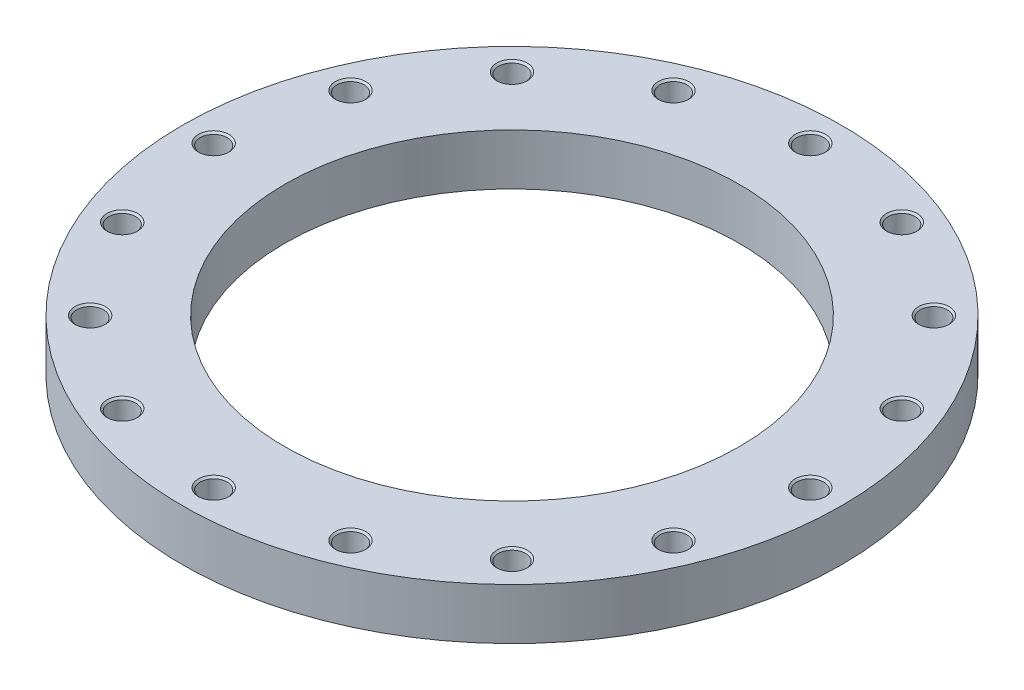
ISO-10303-21;
HEADER;
FILE_DESCRIPTION(('STEP AP214'),'2;1');
FILE_NAME('part.step','',(''),(''),'','','');
FILE_SCHEMA(('AUTOMOTIVE_DESIGN { 1 0 10303 214 1 1 1 1 }'));
ENDSEC;
DATA;
#1=APPLICATION_CONTEXT('core data for automotive mechanical design processes');
#2=APPLICATION_PROTOCOL_DEFINITION('international standard','automotive_design',2000,#1);
#3=PRODUCT_CONTEXT('',#1,'mechanical');
#4=PRODUCT('Part','Part','',(#3));
#5=PRODUCT_RELATED_PRODUCT_CATEGORY('part','',(#4));
#6=PRODUCT_DEFINITION_FORMATION('','',#4);
#7=PRODUCT_DEFINITION_CONTEXT('part definition',#1,'design');
#8=PRODUCT_DEFINITION('design','',#6,#7);
#9=PRODUCT_DEFINITION_SHAPE('','',#8);
#10=(LENGTH_UNIT() NAMED_UNIT(*) SI_UNIT(.MILLI.,.METRE.));
#11=(NAMED_UNIT(*) PLANE_ANGLE_UNIT() SI_UNIT($,.RADIAN.));
#12=(NAMED_UNIT(*) SI_UNIT($,.STERADIAN.) SOLID_ANGLE_UNIT());
#13=UNCERTAINTY_MEASURE_WITH_UNIT(LENGTH_MEASURE(1.E-05),#10,'distance_accuracy_value','');
#14=(GEOMETRIC_REPRESENTATION_CONTEXT(3) GLOBAL_UNCERTAINTY_ASSIGNED_CONTEXT((#13)) GLOBAL_UNIT_ASSIGNED_CONTEXT((#10,
#11,#12)) REPRESENTATION_CONTEXT('',''));
#15=CARTESIAN_POINT('',(0.,0.,0.));
#16=DIRECTION('',(0.,0.,1.));
#17=DIRECTION('',(1.,0.,0.));
#18=AXIS2_PLACEMENT_3D('',#15,#16,#17);
#19=CARTESIAN_POINT('',(0.,22.5,0.));
#20=DIRECTION('',(0.,-1.,0.));
#21=DIRECTION('',(1.,0.,0.));
#22=AXIS2_PLACEMENT_3D('',#19,#20,#21);
#23=CYLINDRICAL_SURFACE('',#22,290.);
#24=CARTESIAN_POINT('',(0.,0.,0.));
#25=DIRECTION('',(0.,1.,0.));
#26=DIRECTION('',(1.,0.,0.));
#27=AXIS2_PLACEMENT_3D('',#24,#25,#26);
#28=CIRCLE('',#27,290.);
#29=CARTESIAN_POINT('',(290.,0.,0.));
#30=VERTEX_POINT('',#29);
#31=EDGE_CURVE('E9',#30,#30,#28,.T.);
#32=ORIENTED_EDGE('',*,*,#31,.T.);
#33=EDGE_LOOP('',(#32));
#34=FACE_BOUND('',#33,.T.);
#35=CARTESIAN_POINT('',(0.,45.,0.));
#36=DIRECTION('',(0.,1.,0.));
#37=DIRECTION('',(1.,0.,0.));
#38=AXIS2_PLACEMENT_3D('',#35,#36,#37);
#39=CIRCLE('',#38,290.);
#40=CARTESIAN_POINT('',(290.,45.,0.));
#41=VERTEX_POINT('',#40);
#42=EDGE_CURVE('E481',#41,#41,#39,.T.);
#43=ORIENTED_EDGE('',*,*,#42,.F.);
#44=EDGE_LOOP('',(#43));
#45=FACE_BOUND('',#44,.T.);
#46=ADVANCED_FACE('F15',(#34,#45),#23,.T.);
#47=CARTESIAN_POINT('',(245.,0.,0.));
#48=DIRECTION('',(0.,-1.,0.));
#49=DIRECTION('',(-1.,0.,0.));
#50=AXIS2_PLACEMENT_3D('',#47,#48,#49);
#51=PLANE('',#50);
#52=CARTESIAN_POINT('',(0.,0.,0.));
#53=DIRECTION('',(0.,1.,0.));
#54=DIRECTION('',(1.,0.,0.));
#55=AXIS2_PLACEMENT_3D('',#52,#53,#54);
#56=CIRCLE('',#55,200.);
#57=CARTESIAN_POINT('',(200.,0.,0.));
#58=VERTEX_POINT('',#57);
#59=EDGE_CURVE('E23',#58,#58,#56,.T.);
#60=ORIENTED_EDGE('',*,*,#59,.T.);
#61=EDGE_LOOP('',(#60));
#62=FACE_BOUND('',#61,.T.);
#63=ORIENTED_EDGE('',*,*,#31,.F.);
#64=EDGE_LOOP('',(#63));
#65=FACE_BOUND('',#64,.T.);
#66=ADVANCED_FACE('F485',(#62,#65),#51,.T.);
#67=CARTESIAN_POINT('',(0.,22.5,0.));
#68=DIRECTION('',(0.,-1.,0.));
#69=DIRECTION('',(1.,0.,0.));
#70=AXIS2_PLACEMENT_3D('',#67,#68,#69);
#71=CYLINDRICAL_SURFACE('',#70,200.);
#72=CARTESIAN_POINT('',(0.,45.,0.));
#73=DIRECTION('',(0.,1.,0.));
#74=DIRECTION('',(1.,0.,0.));
#75=AXIS2_PLACEMENT_3D('',#72,#73,#74);
#76=CIRCLE('',#75,200.);
#77=CARTESIAN_POINT('',(200.,45.,0.));
#78=VERTEX_POINT('',#77);
#79=EDGE_CURVE('E480',#78,#78,#76,.T.);
#80=ORIENTED_EDGE('',*,*,#79,.T.);
#81=EDGE_LOOP('',(#80));
#82=FACE_BOUND('',#81,.T.);
#83=ORIENTED_EDGE('',*,*,#59,.F.);
#84=EDGE_LOOP('',(#83));
#85=FACE_BOUND('',#84,.T.);
#86=ADVANCED_FACE('F488',(#82,#85),#71,.F.);
#87=CARTESIAN_POINT('',(245.,45.,0.));
#88=DIRECTION('',(0.,1.,0.));
#89=DIRECTION('',(1.,0.,0.));
#90=AXIS2_PLACEMENT_3D('',#87,#88,#89);
#91=PLANE('',#90);
#92=ORIENTED_EDGE('',*,*,#42,.T.);
#93=EDGE_LOOP('',(#92));
#94=FACE_BOUND('',#93,.T.);
#95=ORIENTED_EDGE('',*,*,#79,.F.);
#96=EDGE_LOOP('',(#95));
#97=FACE_BOUND('',#96,.T.);
#98=CARTESIAN_POINT('',(262.5,45.,0.));
#99=DIRECTION('',(0.,-1.,0.));
#100=DIRECTION('',(1.,0.,0.));
#101=AXIS2_PLACEMENT_3D('',#98,#99,#100);
#102=CIRCLE('',#101,13.5);
#103=CARTESIAN_POINT('',(276.,45.,0.));
#104=VERTEX_POINT('',#103);
#105=EDGE_CURVE('E476',#104,#104,#102,.T.);
#106=ORIENTED_EDGE('',*,*,#105,.T.);
#107=EDGE_LOOP('',(#106));
#108=FACE_BOUND('',#107,.T.);
#109=CARTESIAN_POINT('',(242.518377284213,45.,-100.454400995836));
#110=DIRECTION('',(0.,-1.,0.));
#111=DIRECTION('',(0.923879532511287,0.,-0.38268343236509));
#112=AXIS2_PLACEMENT_3D('',#109,#110,#111);
#113=CIRCLE('',#112,13.5);
#114=CARTESIAN_POINT('',(254.990750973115,45.,-105.620627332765));
#115=VERTEX_POINT('',#114);
#116=EDGE_CURVE('E465',#115,#115,#113,.T.);
#117=ORIENTED_EDGE('',*,*,#116,.T.);
#118=EDGE_LOOP('',(#117));
#119=FACE_BOUND('',#118,.T.);
#120=CARTESIAN_POINT('',(185.615530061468,45.,-185.615530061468));
#121=DIRECTION('',(0.,-1.,0.));
#122=DIRECTION('',(0.707106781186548,0.,-0.707106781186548));
#123=AXIS2_PLACEMENT_3D('',#120,#121,#122);
#124=CIRCLE('',#123,13.5);
#125=CARTESIAN_POINT('',(195.161471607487,45.,-195.161471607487));
#126=VERTEX_POINT('',#125);
#127=EDGE_CURVE('E459',#126,#126,#124,.T.);
#128=ORIENTED_EDGE('',*,*,#127,.T.);
#129=EDGE_LOOP('',(#128));
#130=FACE_BOUND('',#129,.T.);
#131=CARTESIAN_POINT('',(100.454400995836,45.,-242.518377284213));
#132=DIRECTION('',(0.,-1.,0.));
#133=DIRECTION('',(0.38268343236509,0.,-0.923879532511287));
#134=AXIS2_PLACEMENT_3D('',#131,#132,#133);
#135=CIRCLE('',#134,13.5);
#136=CARTESIAN_POINT('',(105.620627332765,45.,-254.990750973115));
#137=VERTEX_POINT('',#136);
#138=EDGE_CURVE('E519',#137,#137,#135,.T.);
#139=ORIENTED_EDGE('',*,*,#138,.T.);
#140=EDGE_LOOP('',(#139));
#141=FACE_BOUND('',#140,.T.);
#142=CARTESIAN_POINT('',(0.,45.,-262.5));
#143=DIRECTION('',(0.,-1.,0.));
#144=DIRECTION('',(0.,0.,-1.));
#145=AXIS2_PLACEMENT_3D('',#142,#143,#144);
#146=CIRCLE('',#145,13.5);
#147=CARTESIAN_POINT('',(0.,45.,-276.));
#148=VERTEX_POINT('',#147);
#149=EDGE_CURVE('E379',#148,#148,#146,.T.);
#150=ORIENTED_EDGE('',*,*,#149,.T.);
#151=EDGE_LOOP('',(#150));
#152=FACE_BOUND('',#151,.T.);
#153=CARTESIAN_POINT('',(-100.454400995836,45.,-242.518377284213));
#154=DIRECTION('',(0.,-1.,0.));
#155=DIRECTION('',(-0.38268343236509,0.,-0.923879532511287));
#156=AXIS2_PLACEMENT_3D('',#153,#154,#155);
#157=CIRCLE('',#156,13.5);
#158=CARTESIAN_POINT('',(-105.620627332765,45.,-254.990750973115));
#159=VERTEX_POINT('',#158);
#160=EDGE_CURVE('E440',#159,#159,#157,.T.);
#161=ORIENTED_EDGE('',*,*,#160,.T.);
#162=EDGE_LOOP('',(#161));
#163=FACE_BOUND('',#162,.T.);
#164=CARTESIAN_POINT('',(-185.615530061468,45.,-185.615530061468));
#165=DIRECTION('',(0.,-1.,0.));
#166=DIRECTION('',(-0.707106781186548,0.,-0.707106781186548));
#167=AXIS2_PLACEMENT_3D('',#164,#165,#166);
#168=CIRCLE('',#167,13.5);
#169=CARTESIAN_POINT('',(-195.161471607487,45.,-195.161471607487));
#170=VERTEX_POINT('',#169);
#171=EDGE_CURVE('E422',#170,#170,#168,.T.);
#172=ORIENTED_EDGE('',*,*,#171,.T.);
#173=EDGE_LOOP('',(#172));
#174=FACE_BOUND('',#173,.T.);
#175=CARTESIAN_POINT('',(-242.518377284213,45.,-100.454400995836));
#176=DIRECTION('',(0.,-1.,0.));
#177=DIRECTION('',(-0.923879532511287,0.,-0.38268343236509));
#178=AXIS2_PLACEMENT_3D('',#175,#176,#177);
#179=CIRCLE('',#178,13.5);
#180=CARTESIAN_POINT('',(-254.990750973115,45.,-105.620627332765));
#181=VERTEX_POINT('',#180);
#182=EDGE_CURVE('E408',#181,#181,#179,.T.);
#183=ORIENTED_EDGE('',*,*,#182,.T.);
#184=EDGE_LOOP('',(#183));
#185=FACE_BOUND('',#184,.T.);
#186=CARTESIAN_POINT('',(-262.5,45.,0.));
#187=DIRECTION('',(0.,-1.,0.));
#188=DIRECTION('',(-1.,0.,0.));
#189=AXIS2_PLACEMENT_3D('',#186,#187,#188);
#190=CIRCLE('',#189,13.5);
#191=CARTESIAN_POINT('',(-276.,45.,0.));
#192=VERTEX_POINT('',#191);
#193=EDGE_CURVE('E392',#192,#192,#190,.T.);
#194=ORIENTED_EDGE('',*,*,#193,.T.);
#195=EDGE_LOOP('',(#194));
#196=FACE_BOUND('',#195,.T.);
#197=CARTESIAN_POINT('',(-242.518377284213,45.,100.454400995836));
#198=DIRECTION('',(0.,-1.,0.));
#199=DIRECTION('',(-0.923879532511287,0.,0.38268343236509));
#200=AXIS2_PLACEMENT_3D('',#197,#198,#199);
#201=CIRCLE('',#200,13.5);
#202=CARTESIAN_POINT('',(-254.990750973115,45.,105.620627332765));
#203=VERTEX_POINT('',#202);
#204=EDGE_CURVE('E370',#203,#203,#201,.T.);
#205=ORIENTED_EDGE('',*,*,#204,.T.);
#206=EDGE_LOOP('',(#205));
#207=FACE_BOUND('',#206,.T.);
#208=CARTESIAN_POINT('',(-185.615530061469,45.,185.615530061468));
#209=DIRECTION('',(0.,-1.,0.));
#210=DIRECTION('',(-0.707106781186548,0.,0.707106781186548));
#211=AXIS2_PLACEMENT_3D('',#208,#209,#210);
#212=CIRCLE('',#211,13.5);
#213=CARTESIAN_POINT('',(-195.161471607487,45.,195.161471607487));
#214=VERTEX_POINT('',#213);
#215=EDGE_CURVE('E534',#214,#214,#212,.T.);
#216=ORIENTED_EDGE('',*,*,#215,.T.);
#217=EDGE_LOOP('',(#216));
#218=FACE_BOUND('',#217,.T.);
#219=CARTESIAN_POINT('',(-100.454400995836,45.,242.518377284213));
#220=DIRECTION('',(0.,-1.,0.));
#221=DIRECTION('',(-0.382683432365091,0.,0.923879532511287));
#222=AXIS2_PLACEMENT_3D('',#219,#220,#221);
#223=CIRCLE('',#222,13.5);
#224=CARTESIAN_POINT('',(-105.620627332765,45.,254.990750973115));
#225=VERTEX_POINT('',#224);
#226=EDGE_CURVE('E537',#225,#225,#223,.T.);
#227=ORIENTED_EDGE('',*,*,#226,.T.);
#228=EDGE_LOOP('',(#227));
#229=FACE_BOUND('',#228,.T.);
#230=CARTESIAN_POINT('',(0.,45.,262.5));
#231=DIRECTION('',(0.,-1.,0.));
#232=DIRECTION('',(0.,0.,1.));
#233=AXIS2_PLACEMENT_3D('',#230,#231,#232);
#234=CIRCLE('',#233,13.5);
#235=CARTESIAN_POINT('',(0.,45.,276.));
#236=VERTEX_POINT('',#235);
#237=EDGE_CURVE('E540',#236,#236,#234,.T.);
#238=ORIENTED_EDGE('',*,*,#237,.T.);
#239=EDGE_LOOP('',(#238));
#240=FACE_BOUND('',#239,.T.);
#241=CARTESIAN_POINT('',(100.454400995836,45.,242.518377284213));
#242=DIRECTION('',(0.,-1.,0.));
#243=DIRECTION('',(0.38268343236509,0.,0.923879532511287));
#244=AXIS2_PLACEMENT_3D('',#241,#242,#243);
#245=CIRCLE('',#244,13.5);
#246=CARTESIAN_POINT('',(105.620627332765,45.,254.990750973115));
#247=VERTEX_POINT('',#246);
#248=EDGE_CURVE('E543',#247,#247,#245,.T.);
#249=ORIENTED_EDGE('',*,*,#248,.T.);
#250=EDGE_LOOP('',(#249));
#251=FACE_BOUND('',#250,.T.);
#252=CARTESIAN_POINT('',(185.615530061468,45.,185.615530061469));
#253=DIRECTION('',(0.,-1.,0.));
#254=DIRECTION('',(0.707106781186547,0.,0.707106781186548));
#255=AXIS2_PLACEMENT_3D('',#252,#253,#254);
#256=CIRCLE('',#255,13.5);
#257=CARTESIAN_POINT('',(195.161471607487,45.,195.161471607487));
#258=VERTEX_POINT('',#257);
#259=EDGE_CURVE('E547',#258,#258,#256,.T.);
#260=ORIENTED_EDGE('',*,*,#259,.T.);
#261=EDGE_LOOP('',(#260));
#262=FACE_BOUND('',#261,.T.);
#263=CARTESIAN_POINT('',(242.518377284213,45.,100.454400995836));
#264=DIRECTION('',(0.,-1.,0.));
#265=DIRECTION('',(0.923879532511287,0.,0.382683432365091));
#266=AXIS2_PLACEMENT_3D('',#263,#264,#265);
#267=CIRCLE('',#266,13.5);
#268=CARTESIAN_POINT('',(254.990750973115,45.,105.620627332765));
#269=VERTEX_POINT('',#268);
#270=EDGE_CURVE('E549',#269,#269,#267,.T.);
#271=ORIENTED_EDGE('',*,*,#270,.T.);
#272=EDGE_LOOP('',(#271));
#273=FACE_BOUND('',#272,.T.);
#274=ADVANCED_FACE('F490',(#94,#97,#108,#119,#130,#141,#152,#163,#174,#185,#196,#207,#218,#229,
#240,#251,#262,#273),#91,.T.);
#275=CARTESIAN_POINT('',(262.5,5.57162193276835,0.));
#276=DIRECTION('',(0.,1.,0.));
#277=DIRECTION('',(1.,0.,0.));
#278=AXIS2_PLACEMENT_3D('',#275,#276,#277);
#279=CONICAL_SURFACE('',#278,5.938125,1.0471975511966);
#280=CARTESIAN_POINT('',(262.5,9.,0.));
#281=DIRECTION('',(0.,-1.,0.));
#282=DIRECTION('',(1.,0.,0.));
#283=AXIS2_PLACEMENT_3D('',#280,#281,#282);
#284=CIRCLE('',#283,11.87625);
#285=CARTESIAN_POINT('',(274.37625,9.,0.));
#286=VERTEX_POINT('',#285);
#287=EDGE_CURVE('E403',#286,#286,#284,.T.);
#288=ORIENTED_EDGE('',*,*,#287,.F.);
#289=EDGE_LOOP('',(#288));
#290=FACE_BOUND('',#289,.T.);
#291=CARTESIAN_POINT('',(262.5,2.1432438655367,0.));
#292=VERTEX_POINT('',#291);
#293=VERTEX_LOOP('',#292);
#294=FACE_BOUND('',#293,.T.);
#295=ADVANCED_FACE('F498',(#290,#294),#279,.F.);
#296=CARTESIAN_POINT('',(262.5,13.688125,0.));
#297=DIRECTION('',(0.,1.,0.));
#298=DIRECTION('',(1.,0.,0.));
#299=AXIS2_PLACEMENT_3D('',#296,#297,#298);
#300=CYLINDRICAL_SURFACE('',#299,11.87625);
#301=CARTESIAN_POINT('',(262.5,18.37625,0.));
#302=DIRECTION('',(0.,-1.,0.));
#303=DIRECTION('',(1.,0.,0.));
#304=AXIS2_PLACEMENT_3D('',#301,#302,#303);
#305=CIRCLE('',#304,11.87625);
#306=CARTESIAN_POINT('',(274.37625,18.37625,0.));
#307=VERTEX_POINT('',#306);
#308=EDGE_CURVE('E400',#307,#307,#305,.T.);
#309=ORIENTED_EDGE('',*,*,#308,.F.);
#310=EDGE_LOOP('',(#309));
#311=FACE_BOUND('',#310,.T.);
#312=ORIENTED_EDGE('',*,*,#287,.T.);
#313=EDGE_LOOP('',(#312));
#314=FACE_BOUND('',#313,.T.);
#315=ADVANCED_FACE('F692',(#311,#314),#300,.F.);
#316=CARTESIAN_POINT('',(262.5,19.188125,0.));
#317=DIRECTION('',(0.,1.,0.));
#318=DIRECTION('',(1.,0.,0.));
#319=AXIS2_PLACEMENT_3D('',#316,#317,#318);
#320=CONICAL_SURFACE('',#319,12.688125,0.785398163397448);
#321=CARTESIAN_POINT('',(262.5,20.,0.));
#322=DIRECTION('',(0.,-1.,0.));
#323=DIRECTION('',(1.,0.,0.));
#324=AXIS2_PLACEMENT_3D('',#321,#322,#323);
#325=CIRCLE('',#324,13.5);
#326=CARTESIAN_POINT('',(276.,20.,0.));
#327=VERTEX_POINT('',#326);
#328=EDGE_CURVE('E404',#327,#327,#325,.T.);
#329=ORIENTED_EDGE('',*,*,#328,.F.);
#330=EDGE_LOOP('',(#329));
#331=FACE_BOUND('',#330,.T.);
#332=ORIENTED_EDGE('',*,*,#308,.T.);
#333=EDGE_LOOP('',(#332));
#334=FACE_BOUND('',#333,.T.);
#335=ADVANCED_FACE('F695',(#331,#334),#320,.F.);
#336=CARTESIAN_POINT('',(275.188125,20.,0.));
#337=DIRECTION('',(0.,1.,0.));
#338=DIRECTION('',(-1.,0.,0.));
#339=AXIS2_PLACEMENT_3D('',#336,#337,#338);
#340=PLANE('',#339);
#341=CARTESIAN_POINT('',(262.5,20.,0.));
#342=DIRECTION('',(0.,-1.,0.));
#343=DIRECTION('',(1.,0.,0.));
#344=AXIS2_PLACEMENT_3D('',#341,#342,#343);
#345=CIRCLE('',#344,11.87625);
#346=CARTESIAN_POINT('',(274.37625,20.,0.));
#347=VERTEX_POINT('',#346);
#348=EDGE_CURVE('E430',#347,#347,#345,.T.);
#349=ORIENTED_EDGE('',*,*,#348,.F.);
#350=EDGE_LOOP('',(#349));
#351=FACE_BOUND('',#350,.T.);
#352=ORIENTED_EDGE('',*,*,#328,.T.);
#353=EDGE_LOOP('',(#352));
#354=FACE_BOUND('',#353,.T.);
#355=ADVANCED_FACE('F831',(#351,#354),#340,.F.);
#356=CARTESIAN_POINT('',(262.5,31.688125,0.));
#357=DIRECTION('',(0.,1.,0.));
#358=DIRECTION('',(1.,0.,0.));
#359=AXIS2_PLACEMENT_3D('',#356,#357,#358);
#360=CYLINDRICAL_SURFACE('',#359,11.87625);
#361=CARTESIAN_POINT('',(262.5,43.37625,0.));
#362=DIRECTION('',(0.,-1.,0.));
#363=DIRECTION('',(1.,0.,0.));
#364=AXIS2_PLACEMENT_3D('',#361,#362,#363);
#365=CIRCLE('',#364,11.87625);
#366=CARTESIAN_POINT('',(274.37625,43.37625,0.));
#367=VERTEX_POINT('',#366);
#368=EDGE_CURVE('E474',#367,#367,#365,.T.);
#369=ORIENTED_EDGE('',*,*,#368,.F.);
#370=EDGE_LOOP('',(#369));
#371=FACE_BOUND('',#370,.T.);
#372=ORIENTED_EDGE('',*,*,#348,.T.);
#373=EDGE_LOOP('',(#372));
#374=FACE_BOUND('',#373,.T.);
#375=ADVANCED_FACE('F827',(#371,#374),#360,.F.);
#376=CARTESIAN_POINT('',(262.5,44.188125,0.));
#377=DIRECTION('',(0.,1.,0.));
#378=DIRECTION('',(1.,0.,0.));
#379=AXIS2_PLACEMENT_3D('',#376,#377,#378);
#380=CONICAL_SURFACE('',#379,12.688125,0.785398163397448);
#381=ORIENTED_EDGE('',*,*,#105,.F.);
#382=EDGE_LOOP('',(#381));
#383=FACE_BOUND('',#382,.T.);
#384=ORIENTED_EDGE('',*,*,#368,.T.);
#385=EDGE_LOOP('',(#384));
#386=FACE_BOUND('',#385,.T.);
#387=ADVANCED_FACE('F823',(#383,#386),#380,.F.);
#388=CARTESIAN_POINT('',(242.518377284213,5.57162193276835,-100.454400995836));
#389=DIRECTION('',(0.,1.,0.));
#390=DIRECTION('',(0.923879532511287,0.,-0.38268343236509));
#391=AXIS2_PLACEMENT_3D('',#388,#389,#390);
#392=CONICAL_SURFACE('',#391,5.938125,1.0471975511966);
#393=CARTESIAN_POINT('',(242.518377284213,9.,-100.454400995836));
#394=DIRECTION('',(0.,-1.,0.));
#395=DIRECTION('',(0.923879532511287,0.,-0.38268343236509));
#396=AXIS2_PLACEMENT_3D('',#393,#394,#395);
#397=CIRCLE('',#396,11.87625);
#398=CARTESIAN_POINT('',(253.4906015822,9.,-104.999245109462));
#399=VERTEX_POINT('',#398);
#400=EDGE_CURVE('E472',#399,#399,#397,.T.);
#401=ORIENTED_EDGE('',*,*,#400,.F.);
#402=EDGE_LOOP('',(#401));
#403=FACE_BOUND('',#402,.T.);
#404=CARTESIAN_POINT('',(242.518377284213,2.1432438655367,-100.454400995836));
#405=VERTEX_POINT('',#404);
#406=VERTEX_LOOP('',#405);
#407=FACE_BOUND('',#406,.T.);
#408=ADVANCED_FACE('F725',(#403,#407),#392,.F.);
#409=CARTESIAN_POINT('',(242.518377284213,13.688125,-100.454400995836));
#410=DIRECTION('',(0.,1.,0.));
#411=DIRECTION('',(0.923879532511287,0.,-0.38268343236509));
#412=AXIS2_PLACEMENT_3D('',#409,#410,#411);
#413=CYLINDRICAL_SURFACE('',#412,11.87625);
#414=CARTESIAN_POINT('',(242.518377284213,18.37625,-100.454400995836));
#415=DIRECTION('',(0.,-1.,0.));
#416=DIRECTION('',(0.923879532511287,0.,-0.38268343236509));
#417=AXIS2_PLACEMENT_3D('',#414,#415,#416);
#418=CIRCLE('',#417,11.87625);
#419=CARTESIAN_POINT('',(253.4906015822,18.37625,-104.999245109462));
#420=VERTEX_POINT('',#419);
#421=EDGE_CURVE('E470',#420,#420,#418,.T.);
#422=ORIENTED_EDGE('',*,*,#421,.F.);
#423=EDGE_LOOP('',(#422));
#424=FACE_BOUND('',#423,.T.);
#425=ORIENTED_EDGE('',*,*,#400,.T.);
#426=EDGE_LOOP('',(#425));
#427=FACE_BOUND('',#426,.T.);
#428=ADVANCED_FACE('F721',(#424,#427),#413,.F.);
#429=CARTESIAN_POINT('',(242.518377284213,19.188125,-100.454400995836));
#430=DIRECTION('',(0.,1.,0.));
#431=DIRECTION('',(0.923879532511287,0.,-0.38268343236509));
#432=AXIS2_PLACEMENT_3D('',#429,#430,#431);
#433=CONICAL_SURFACE('',#432,12.688125,0.785398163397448);
#434=CARTESIAN_POINT('',(242.518377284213,20.,-100.454400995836));
#435=DIRECTION('',(0.,-1.,0.));
#436=DIRECTION('',(0.923879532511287,0.,-0.38268343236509));
#437=AXIS2_PLACEMENT_3D('',#434,#435,#436);
#438=CIRCLE('',#437,13.5);
#439=CARTESIAN_POINT('',(254.990750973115,20.,-105.620627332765));
#440=VERTEX_POINT('',#439);
#441=EDGE_CURVE('E468',#440,#440,#438,.T.);
#442=ORIENTED_EDGE('',*,*,#441,.F.);
#443=EDGE_LOOP('',(#442));
#444=FACE_BOUND('',#443,.T.);
#445=ORIENTED_EDGE('',*,*,#421,.T.);
#446=EDGE_LOOP('',(#445));
#447=FACE_BOUND('',#446,.T.);
#448=ADVANCED_FACE('F724',(#444,#447),#433,.F.);
#449=CARTESIAN_POINT('',(254.240676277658,20.,-105.309936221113));
#450=DIRECTION('',(0.,1.,0.));
#451=DIRECTION('',(-0.923879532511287,0.,0.38268343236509));
#452=AXIS2_PLACEMENT_3D('',#449,#450,#451);
#453=PLANE('',#452);
#454=CARTESIAN_POINT('',(242.518377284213,20.,-100.454400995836));
#455=DIRECTION('',(0.,-1.,0.));
#456=DIRECTION('',(0.923879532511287,0.,-0.38268343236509));
#457=AXIS2_PLACEMENT_3D('',#454,#455,#456);
#458=CIRCLE('',#457,11.87625);
#459=CARTESIAN_POINT('',(253.4906015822,20.,-104.999245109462));
#460=VERTEX_POINT('',#459);
#461=EDGE_CURVE('E467',#460,#460,#458,.T.);
#462=ORIENTED_EDGE('',*,*,#461,.F.);
#463=EDGE_LOOP('',(#462));
#464=FACE_BOUND('',#463,.T.);
#465=ORIENTED_EDGE('',*,*,#441,.T.);
#466=EDGE_LOOP('',(#465));
#467=FACE_BOUND('',#466,.T.);
#468=ADVANCED_FACE('F892',(#464,#467),#453,.F.);
#469=CARTESIAN_POINT('',(242.518377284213,31.688125,-100.454400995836));
#470=DIRECTION('',(0.,1.,0.));
#471=DIRECTION('',(0.923879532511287,0.,-0.38268343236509));
#472=AXIS2_PLACEMENT_3D('',#469,#470,#471);
#473=CYLINDRICAL_SURFACE('',#472,11.87625);
#474=CARTESIAN_POINT('',(242.518377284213,43.37625,-100.454400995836));
#475=DIRECTION('',(0.,-1.,0.));
#476=DIRECTION('',(0.923879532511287,0.,-0.38268343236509));
#477=AXIS2_PLACEMENT_3D('',#474,#475,#476);
#478=CIRCLE('',#477,11.87625);
#479=CARTESIAN_POINT('',(253.4906015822,43.37625,-104.999245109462));
#480=VERTEX_POINT('',#479);
#481=EDGE_CURVE('E462',#480,#480,#478,.T.);
#482=ORIENTED_EDGE('',*,*,#481,.F.);
#483=EDGE_LOOP('',(#482));
#484=FACE_BOUND('',#483,.T.);
#485=ORIENTED_EDGE('',*,*,#461,.T.);
#486=EDGE_LOOP('',(#485));
#487=FACE_BOUND('',#486,.T.);
#488=ADVANCED_FACE('F819',(#484,#487),#473,.F.);
#489=CARTESIAN_POINT('',(242.518377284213,44.188125,-100.454400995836));
#490=DIRECTION('',(0.,1.,0.));
#491=DIRECTION('',(0.923879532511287,0.,-0.38268343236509));
#492=AXIS2_PLACEMENT_3D('',#489,#490,#491);
#493=CONICAL_SURFACE('',#492,12.688125,0.785398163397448);
#494=ORIENTED_EDGE('',*,*,#116,.F.);
#495=EDGE_LOOP('',(#494));
#496=FACE_BOUND('',#495,.T.);
#497=ORIENTED_EDGE('',*,*,#481,.T.);
#498=EDGE_LOOP('',(#497));
#499=FACE_BOUND('',#498,.T.);
#500=ADVANCED_FACE('F815',(#496,#499),#493,.F.);
#501=CARTESIAN_POINT('',(185.615530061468,5.57162193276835,-185.615530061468));
#502=DIRECTION('',(0.,1.,0.));
#503=DIRECTION('',(0.707106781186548,0.,-0.707106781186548));
#504=AXIS2_PLACEMENT_3D('',#501,#502,#503);
#505=CONICAL_SURFACE('',#504,5.938125,1.0471975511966);
#506=CARTESIAN_POINT('',(185.615530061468,9.,-185.615530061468));
#507=DIRECTION('',(0.,-1.,0.));
#508=DIRECTION('',(0.707106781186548,0.,-0.707106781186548));
#509=AXIS2_PLACEMENT_3D('',#506,#507,#508);
#510=CIRCLE('',#509,11.87625);
#511=CARTESIAN_POINT('',(194.013306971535,9.,-194.013306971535));
#512=VERTEX_POINT('',#511);
#513=EDGE_CURVE('E460',#512,#512,#510,.T.);
#514=ORIENTED_EDGE('',*,*,#513,.F.);
#515=EDGE_LOOP('',(#514));
#516=FACE_BOUND('',#515,.T.);
#517=CARTESIAN_POINT('',(185.615530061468,2.1432438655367,-185.615530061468));
#518=VERTEX_POINT('',#517);
#519=VERTEX_LOOP('',#518);
#520=FACE_BOUND('',#519,.T.);
#521=ADVANCED_FACE('F811',(#516,#520),#505,.F.);
#522=CARTESIAN_POINT('',(185.615530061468,13.688125,-185.615530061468));
#523=DIRECTION('',(0.,1.,0.));
#524=DIRECTION('',(0.707106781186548,0.,-0.707106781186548));
#525=AXIS2_PLACEMENT_3D('',#522,#523,#524);
#526=CYLINDRICAL_SURFACE('',#525,11.87625);
#527=CARTESIAN_POINT('',(185.615530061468,18.37625,-185.615530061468));
#528=DIRECTION('',(0.,-1.,0.));
#529=DIRECTION('',(0.707106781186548,0.,-0.707106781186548));
#530=AXIS2_PLACEMENT_3D('',#527,#528,#529);
#531=CIRCLE('',#530,11.87625);
#532=CARTESIAN_POINT('',(194.013306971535,18.37625,-194.013306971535));
#533=VERTEX_POINT('',#532);
#534=EDGE_CURVE('E463',#533,#533,#531,.T.);
#535=ORIENTED_EDGE('',*,*,#534,.F.);
#536=EDGE_LOOP('',(#535));
#537=FACE_BOUND('',#536,.T.);
#538=ORIENTED_EDGE('',*,*,#513,.T.);
#539=EDGE_LOOP('',(#538));
#540=FACE_BOUND('',#539,.T.);
#541=ADVANCED_FACE('F807',(#537,#540),#526,.F.);
#542=CARTESIAN_POINT('',(185.615530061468,19.188125,-185.615530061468));
#543=DIRECTION('',(0.,1.,0.));
#544=DIRECTION('',(0.707106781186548,0.,-0.707106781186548));
#545=AXIS2_PLACEMENT_3D('',#542,#543,#544);
#546=CONICAL_SURFACE('',#545,12.688125,0.785398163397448);
#547=CARTESIAN_POINT('',(185.615530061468,20.,-185.615530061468));
#548=DIRECTION('',(0.,-1.,0.));
#549=DIRECTION('',(0.707106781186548,0.,-0.707106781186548));
#550=AXIS2_PLACEMENT_3D('',#547,#548,#549);
#551=CIRCLE('',#550,13.5);
#552=CARTESIAN_POINT('',(195.161471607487,20.,-195.161471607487));
#553=VERTEX_POINT('',#552);
#554=EDGE_CURVE('E566',#553,#553,#551,.T.);
#555=ORIENTED_EDGE('',*,*,#554,.F.);
#556=EDGE_LOOP('',(#555));
#557=FACE_BOUND('',#556,.T.);
#558=ORIENTED_EDGE('',*,*,#534,.T.);
#559=EDGE_LOOP('',(#558));
#560=FACE_BOUND('',#559,.T.);
#561=ADVANCED_FACE('F810',(#557,#560),#546,.F.);
#562=CARTESIAN_POINT('',(194.587389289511,20.,-194.587389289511));
#563=DIRECTION('',(0.,1.,0.));
#564=DIRECTION('',(-0.707106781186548,0.,0.707106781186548));
#565=AXIS2_PLACEMENT_3D('',#562,#563,#564);
#566=PLANE('',#565);
#567=CARTESIAN_POINT('',(185.615530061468,20.,-185.615530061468));
#568=DIRECTION('',(0.,-1.,0.));
#569=DIRECTION('',(0.707106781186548,0.,-0.707106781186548));
#570=AXIS2_PLACEMENT_3D('',#567,#568,#569);
#571=CIRCLE('',#570,11.87625);
#572=CARTESIAN_POINT('',(194.013306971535,20.,-194.013306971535));
#573=VERTEX_POINT('',#572);
#574=EDGE_CURVE('E568',#573,#573,#571,.T.);
#575=ORIENTED_EDGE('',*,*,#574,.F.);
#576=EDGE_LOOP('',(#575));
#577=FACE_BOUND('',#576,.T.);
#578=ORIENTED_EDGE('',*,*,#554,.T.);
#579=EDGE_LOOP('',(#578));
#580=FACE_BOUND('',#579,.T.);
#581=ADVANCED_FACE('F678',(#577,#580),#566,.F.);
#582=CARTESIAN_POINT('',(185.615530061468,31.688125,-185.615530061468));
#583=DIRECTION('',(0.,1.,0.));
#584=DIRECTION('',(0.707106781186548,0.,-0.707106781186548));
#585=AXIS2_PLACEMENT_3D('',#582,#583,#584);
#586=CYLINDRICAL_SURFACE('',#585,11.87625);
#587=CARTESIAN_POINT('',(185.615530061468,43.37625,-185.615530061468));
#588=DIRECTION('',(0.,-1.,0.));
#589=DIRECTION('',(0.707106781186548,0.,-0.707106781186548));
#590=AXIS2_PLACEMENT_3D('',#587,#588,#589);
#591=CIRCLE('',#590,11.87625);
#592=CARTESIAN_POINT('',(194.013306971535,43.37625,-194.013306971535));
#593=VERTEX_POINT('',#592);
#594=EDGE_CURVE('E457',#593,#593,#591,.T.);
#595=ORIENTED_EDGE('',*,*,#594,.F.);
#596=EDGE_LOOP('',(#595));
#597=FACE_BOUND('',#596,.T.);
#598=ORIENTED_EDGE('',*,*,#574,.T.);
#599=EDGE_LOOP('',(#598));
#600=FACE_BOUND('',#599,.T.);
#601=ADVANCED_FACE('F674',(#597,#600),#586,.F.);
#602=CARTESIAN_POINT('',(185.615530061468,44.188125,-185.615530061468));
#603=DIRECTION('',(0.,1.,0.));
#604=DIRECTION('',(0.707106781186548,0.,-0.707106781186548));
#605=AXIS2_PLACEMENT_3D('',#602,#603,#604);
#606=CONICAL_SURFACE('',#605,12.688125,0.785398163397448);
#607=ORIENTED_EDGE('',*,*,#127,.F.);
#608=EDGE_LOOP('',(#607));
#609=FACE_BOUND('',#608,.T.);
#610=ORIENTED_EDGE('',*,*,#594,.T.);
#611=EDGE_LOOP('',(#610));
#612=FACE_BOUND('',#611,.T.);
#613=ADVANCED_FACE('F677',(#609,#612),#606,.F.);
#614=CARTESIAN_POINT('',(100.454400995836,5.57162193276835,-242.518377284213));
#615=DIRECTION('',(0.,1.,0.));
#616=DIRECTION('',(0.38268343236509,0.,-0.923879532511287));
#617=AXIS2_PLACEMENT_3D('',#614,#615,#616);
#618=CONICAL_SURFACE('',#617,5.938125,1.0471975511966);
#619=CARTESIAN_POINT('',(100.454400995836,9.,-242.518377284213));
#620=DIRECTION('',(0.,-1.,0.));
#621=DIRECTION('',(0.38268343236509,0.,-0.923879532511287));
#622=AXIS2_PLACEMENT_3D('',#619,#620,#621);
#623=CIRCLE('',#622,11.87625);
#624=CARTESIAN_POINT('',(104.999245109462,9.,-253.4906015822));
#625=VERTEX_POINT('',#624);
#626=EDGE_CURVE('E437',#625,#625,#623,.T.);
#627=ORIENTED_EDGE('',*,*,#626,.F.);
#628=EDGE_LOOP('',(#627));
#629=FACE_BOUND('',#628,.T.);
#630=CARTESIAN_POINT('',(100.454400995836,2.1432438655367,-242.518377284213));
#631=VERTEX_POINT('',#630);
#632=VERTEX_LOOP('',#631);
#633=FACE_BOUND('',#632,.T.);
#634=ADVANCED_FACE('F759',(#629,#633),#618,.F.);
#635=CARTESIAN_POINT('',(100.454400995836,13.688125,-242.518377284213));
#636=DIRECTION('',(0.,1.,0.));
#637=DIRECTION('',(0.38268343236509,0.,-0.923879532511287));
#638=AXIS2_PLACEMENT_3D('',#635,#636,#637);
#639=CYLINDRICAL_SURFACE('',#638,11.87625);
#640=CARTESIAN_POINT('',(100.454400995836,18.37625,-242.518377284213));
#641=DIRECTION('',(0.,-1.,0.));
#642=DIRECTION('',(0.38268343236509,0.,-0.923879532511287));
#643=AXIS2_PLACEMENT_3D('',#640,#641,#642);
#644=CIRCLE('',#643,11.87625);
#645=CARTESIAN_POINT('',(104.999245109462,18.37625,-253.4906015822));
#646=VERTEX_POINT('',#645);
#647=EDGE_CURVE('E435',#646,#646,#644,.T.);
#648=ORIENTED_EDGE('',*,*,#647,.F.);
#649=EDGE_LOOP('',(#648));
#650=FACE_BOUND('',#649,.T.);
#651=ORIENTED_EDGE('',*,*,#626,.T.);
#652=EDGE_LOOP('',(#651));
#653=FACE_BOUND('',#652,.T.);
#654=ADVANCED_FACE('F802',(#650,#653),#639,.F.);
#655=CARTESIAN_POINT('',(100.454400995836,19.188125,-242.518377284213));
#656=DIRECTION('',(0.,1.,0.));
#657=DIRECTION('',(0.38268343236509,0.,-0.923879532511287));
#658=AXIS2_PLACEMENT_3D('',#655,#656,#657);
#659=CONICAL_SURFACE('',#658,12.688125,0.785398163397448);
#660=CARTESIAN_POINT('',(100.454400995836,20.,-242.518377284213));
#661=DIRECTION('',(0.,-1.,0.));
#662=DIRECTION('',(0.38268343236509,0.,-0.923879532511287));
#663=AXIS2_PLACEMENT_3D('',#660,#661,#662);
#664=CIRCLE('',#663,13.5);
#665=CARTESIAN_POINT('',(105.620627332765,20.,-254.990750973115));
#666=VERTEX_POINT('',#665);
#667=EDGE_CURVE('E438',#666,#666,#664,.T.);
#668=ORIENTED_EDGE('',*,*,#667,.F.);
#669=EDGE_LOOP('',(#668));
#670=FACE_BOUND('',#669,.T.);
#671=ORIENTED_EDGE('',*,*,#647,.T.);
#672=EDGE_LOOP('',(#671));
#673=FACE_BOUND('',#672,.T.);
#674=ADVANCED_FACE('F805',(#670,#673),#659,.F.);
#675=CARTESIAN_POINT('',(105.309936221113,20.,-254.240676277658));
#676=DIRECTION('',(0.,1.,0.));
#677=DIRECTION('',(-0.38268343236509,0.,0.923879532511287));
#678=AXIS2_PLACEMENT_3D('',#675,#676,#677);
#679=PLANE('',#678);
#680=CARTESIAN_POINT('',(100.454400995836,20.,-242.518377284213));
#681=DIRECTION('',(0.,-1.,0.));
#682=DIRECTION('',(0.38268343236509,0.,-0.923879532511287));
#683=AXIS2_PLACEMENT_3D('',#680,#681,#682);
#684=CIRCLE('',#683,11.87625);
#685=CARTESIAN_POINT('',(104.999245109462,20.,-253.4906015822));
#686=VERTEX_POINT('',#685);
#687=EDGE_CURVE('E610',#686,#686,#684,.T.);
#688=ORIENTED_EDGE('',*,*,#687,.F.);
#689=EDGE_LOOP('',(#688));
#690=FACE_BOUND('',#689,.T.);
#691=ORIENTED_EDGE('',*,*,#667,.T.);
#692=EDGE_LOOP('',(#691));
#693=FACE_BOUND('',#692,.T.);
#694=ADVANCED_FACE('F800',(#690,#693),#679,.F.);
#695=CARTESIAN_POINT('',(100.454400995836,31.688125,-242.518377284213));
#696=DIRECTION('',(0.,1.,0.));
#697=DIRECTION('',(0.38268343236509,0.,-0.923879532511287));
#698=AXIS2_PLACEMENT_3D('',#695,#696,#697);
#699=CYLINDRICAL_SURFACE('',#698,11.87625);
#700=CARTESIAN_POINT('',(100.454400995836,43.37625,-242.518377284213));
#701=DIRECTION('',(0.,-1.,0.));
#702=DIRECTION('',(0.38268343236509,0.,-0.923879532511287));
#703=AXIS2_PLACEMENT_3D('',#700,#701,#702);
#704=CIRCLE('',#703,11.87625);
#705=CARTESIAN_POINT('',(104.999245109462,43.37625,-253.4906015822));
#706=VERTEX_POINT('',#705);
#707=EDGE_CURVE('E455',#706,#706,#704,.T.);
#708=ORIENTED_EDGE('',*,*,#707,.F.);
#709=EDGE_LOOP('',(#708));
#710=FACE_BOUND('',#709,.T.);
#711=ORIENTED_EDGE('',*,*,#687,.T.);
#712=EDGE_LOOP('',(#711));
#713=FACE_BOUND('',#712,.T.);
#714=ADVANCED_FACE('F743',(#710,#713),#699,.F.);
#715=CARTESIAN_POINT('',(100.454400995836,44.188125,-242.518377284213));
#716=DIRECTION('',(0.,1.,0.));
#717=DIRECTION('',(0.38268343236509,0.,-0.923879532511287));
#718=AXIS2_PLACEMENT_3D('',#715,#716,#717);
#719=CONICAL_SURFACE('',#718,12.688125,0.785398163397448);
#720=ORIENTED_EDGE('',*,*,#138,.F.);
#721=EDGE_LOOP('',(#720));
#722=FACE_BOUND('',#721,.T.);
#723=ORIENTED_EDGE('',*,*,#707,.T.);
#724=EDGE_LOOP('',(#723));
#725=FACE_BOUND('',#724,.T.);
#726=ADVANCED_FACE('F739',(#722,#725),#719,.F.);
#727=CARTESIAN_POINT('',(0.,5.57162193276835,-262.5));
#728=DIRECTION('',(0.,1.,0.));
#729=DIRECTION('',(0.,0.,-1.));
#730=AXIS2_PLACEMENT_3D('',#727,#728,#729);
#731=CONICAL_SURFACE('',#730,5.938125,1.0471975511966);
#732=CARTESIAN_POINT('',(0.,9.,-262.5));
#733=DIRECTION('',(0.,-1.,0.));
#734=DIRECTION('',(0.,0.,-1.));
#735=AXIS2_PLACEMENT_3D('',#732,#733,#734);
#736=CIRCLE('',#735,11.87625);
#737=CARTESIAN_POINT('',(0.,9.,-274.37625));
#738=VERTEX_POINT('',#737);
#739=EDGE_CURVE('E453',#738,#738,#736,.T.);
#740=ORIENTED_EDGE('',*,*,#739,.F.);
#741=EDGE_LOOP('',(#740));
#742=FACE_BOUND('',#741,.T.);
#743=CARTESIAN_POINT('',(0.,2.1432438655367,-262.5));
#744=VERTEX_POINT('',#743);
#745=VERTEX_LOOP('',#744);
#746=FACE_BOUND('',#745,.T.);
#747=ADVANCED_FACE('F742',(#742,#746),#731,.F.);
#748=CARTESIAN_POINT('',(0.,13.688125,-262.5));
#749=DIRECTION('',(0.,1.,0.));
#750=DIRECTION('',(0.,0.,-1.));
#751=AXIS2_PLACEMENT_3D('',#748,#749,#750);
#752=CYLINDRICAL_SURFACE('',#751,11.87625);
#753=CARTESIAN_POINT('',(0.,18.37625,-262.5));
#754=DIRECTION('',(0.,-1.,0.));
#755=DIRECTION('',(0.,0.,-1.));
#756=AXIS2_PLACEMENT_3D('',#753,#754,#755);
#757=CIRCLE('',#756,11.87625);
#758=CARTESIAN_POINT('',(0.,18.37625,-274.37625));
#759=VERTEX_POINT('',#758);
#760=EDGE_CURVE('E451',#759,#759,#757,.T.);
#761=ORIENTED_EDGE('',*,*,#760,.F.);
#762=EDGE_LOOP('',(#761));
#763=FACE_BOUND('',#762,.T.);
#764=ORIENTED_EDGE('',*,*,#739,.T.);
#765=EDGE_LOOP('',(#764));
#766=FACE_BOUND('',#765,.T.);
#767=ADVANCED_FACE('F796',(#763,#766),#752,.F.);
#768=CARTESIAN_POINT('',(0.,19.188125,-262.5));
#769=DIRECTION('',(0.,1.,0.));
#770=DIRECTION('',(0.,0.,-1.));
#771=AXIS2_PLACEMENT_3D('',#768,#769,#770);
#772=CONICAL_SURFACE('',#771,12.688125,0.785398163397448);
#773=CARTESIAN_POINT('',(0.,20.,-262.5));
#774=DIRECTION('',(0.,-1.,0.));
#775=DIRECTION('',(0.,0.,-1.));
#776=AXIS2_PLACEMENT_3D('',#773,#774,#775);
#777=CIRCLE('',#776,13.5);
#778=CARTESIAN_POINT('',(0.,20.,-276.));
#779=VERTEX_POINT('',#778);
#780=EDGE_CURVE('E450',#779,#779,#777,.T.);
#781=ORIENTED_EDGE('',*,*,#780,.F.);
#782=EDGE_LOOP('',(#781));
#783=FACE_BOUND('',#782,.T.);
#784=ORIENTED_EDGE('',*,*,#760,.T.);
#785=EDGE_LOOP('',(#784));
#786=FACE_BOUND('',#785,.T.);
#787=ADVANCED_FACE('F863',(#783,#786),#772,.F.);
#788=CARTESIAN_POINT('',(0.,20.,-275.188125));
#789=DIRECTION('',(0.,1.,0.));
#790=DIRECTION('',(0.,0.,1.));
#791=AXIS2_PLACEMENT_3D('',#788,#789,#790);
#792=PLANE('',#791);
#793=CARTESIAN_POINT('',(0.,20.,-262.5));
#794=DIRECTION('',(0.,-1.,0.));
#795=DIRECTION('',(0.,0.,-1.));
#796=AXIS2_PLACEMENT_3D('',#793,#794,#795);
#797=CIRCLE('',#796,11.87625);
#798=CARTESIAN_POINT('',(0.,20.,-274.37625));
#799=VERTEX_POINT('',#798);
#800=EDGE_CURVE('E381',#799,#799,#797,.T.);
#801=ORIENTED_EDGE('',*,*,#800,.F.);
#802=EDGE_LOOP('',(#801));
#803=FACE_BOUND('',#802,.T.);
#804=ORIENTED_EDGE('',*,*,#780,.T.);
#805=EDGE_LOOP('',(#804));
#806=FACE_BOUND('',#805,.T.);
#807=ADVANCED_FACE('F792',(#803,#806),#792,.F.);
#808=CARTESIAN_POINT('',(0.,31.688125,-262.5));
#809=DIRECTION('',(0.,1.,0.));
#810=DIRECTION('',(0.,0.,-1.));
#811=AXIS2_PLACEMENT_3D('',#808,#809,#810);
#812=CYLINDRICAL_SURFACE('',#811,11.87625);
#813=CARTESIAN_POINT('',(0.,43.37625,-262.5));
#814=DIRECTION('',(0.,-1.,0.));
#815=DIRECTION('',(0.,0.,-1.));
#816=AXIS2_PLACEMENT_3D('',#813,#814,#815);
#817=CIRCLE('',#816,11.87625);
#818=CARTESIAN_POINT('',(0.,43.37625,-274.37625));
#819=VERTEX_POINT('',#818);
#820=EDGE_CURVE('E382',#819,#819,#817,.T.);
#821=ORIENTED_EDGE('',*,*,#820,.F.);
#822=EDGE_LOOP('',(#821));
#823=FACE_BOUND('',#822,.T.);
#824=ORIENTED_EDGE('',*,*,#800,.T.);
#825=EDGE_LOOP('',(#824));
#826=FACE_BOUND('',#825,.T.);
#827=ADVANCED_FACE('F788',(#823,#826),#812,.F.);
#828=CARTESIAN_POINT('',(0.,44.188125,-262.5));
#829=DIRECTION('',(0.,1.,0.));
#830=DIRECTION('',(0.,0.,-1.));
#831=AXIS2_PLACEMENT_3D('',#828,#829,#830);
#832=CONICAL_SURFACE('',#831,12.688125,0.785398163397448);
#833=ORIENTED_EDGE('',*,*,#149,.F.);
#834=EDGE_LOOP('',(#833));
#835=FACE_BOUND('',#834,.T.);
#836=ORIENTED_EDGE('',*,*,#820,.T.);
#837=EDGE_LOOP('',(#836));
#838=FACE_BOUND('',#837,.T.);
#839=ADVANCED_FACE('F784',(#835,#838),#832,.F.);
#840=CARTESIAN_POINT('',(-100.454400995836,5.57162193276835,-242.518377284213));
#841=DIRECTION('',(0.,1.,0.));
#842=DIRECTION('',(-0.38268343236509,0.,-0.923879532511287));
#843=AXIS2_PLACEMENT_3D('',#840,#841,#842);
#844=CONICAL_SURFACE('',#843,5.938125,1.0471975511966);
#845=CARTESIAN_POINT('',(-100.454400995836,9.,-242.518377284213));
#846=DIRECTION('',(0.,-1.,0.));
#847=DIRECTION('',(-0.38268343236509,0.,-0.923879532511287));
#848=AXIS2_PLACEMENT_3D('',#845,#846,#847);
#849=CIRCLE('',#848,11.87625);
#850=CARTESIAN_POINT('',(-104.999245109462,9.,-253.4906015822));
#851=VERTEX_POINT('',#850);
#852=EDGE_CURVE('E414',#851,#851,#849,.T.);
#853=ORIENTED_EDGE('',*,*,#852,.F.);
#854=EDGE_LOOP('',(#853));
#855=FACE_BOUND('',#854,.T.);
#856=CARTESIAN_POINT('',(-100.454400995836,2.1432438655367,-242.518377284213));
#857=VERTEX_POINT('',#856);
#858=VERTEX_LOOP('',#857);
#859=FACE_BOUND('',#858,.T.);
#860=ADVANCED_FACE('F781',(#855,#859),#844,.F.);
#861=CARTESIAN_POINT('',(-100.454400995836,13.688125,-242.518377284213));
#862=DIRECTION('',(0.,1.,0.));
#863=DIRECTION('',(-0.38268343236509,0.,-0.923879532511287));
#864=AXIS2_PLACEMENT_3D('',#861,#862,#863);
#865=CYLINDRICAL_SURFACE('',#864,11.87625);
#866=CARTESIAN_POINT('',(-100.454400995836,18.37625,-242.518377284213));
#867=DIRECTION('',(0.,-1.,0.));
#868=DIRECTION('',(-0.38268343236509,0.,-0.923879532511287));
#869=AXIS2_PLACEMENT_3D('',#866,#867,#868);
#870=CIRCLE('',#869,11.87625);
#871=CARTESIAN_POINT('',(-104.999245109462,18.37625,-253.4906015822));
#872=VERTEX_POINT('',#871);
#873=EDGE_CURVE('E446',#872,#872,#870,.T.);
#874=ORIENTED_EDGE('',*,*,#873,.F.);
#875=EDGE_LOOP('',(#874));
#876=FACE_BOUND('',#875,.T.);
#877=ORIENTED_EDGE('',*,*,#852,.T.);
#878=EDGE_LOOP('',(#877));
#879=FACE_BOUND('',#878,.T.);
#880=ADVANCED_FACE('F779',(#876,#879),#865,.F.);
#881=CARTESIAN_POINT('',(-100.454400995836,19.188125,-242.518377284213));
#882=DIRECTION('',(0.,1.,0.));
#883=DIRECTION('',(-0.38268343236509,0.,-0.923879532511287));
#884=AXIS2_PLACEMENT_3D('',#881,#882,#883);
#885=CONICAL_SURFACE('',#884,12.688125,0.785398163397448);
#886=CARTESIAN_POINT('',(-100.454400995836,20.,-242.518377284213));
#887=DIRECTION('',(0.,-1.,0.));
#888=DIRECTION('',(-0.38268343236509,0.,-0.923879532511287));
#889=AXIS2_PLACEMENT_3D('',#886,#887,#888);
#890=CIRCLE('',#889,13.5);
#891=CARTESIAN_POINT('',(-105.620627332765,20.,-254.990750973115));
#892=VERTEX_POINT('',#891);
#893=EDGE_CURVE('E444',#892,#892,#890,.T.);
#894=ORIENTED_EDGE('',*,*,#893,.F.);
#895=EDGE_LOOP('',(#894));
#896=FACE_BOUND('',#895,.T.);
#897=ORIENTED_EDGE('',*,*,#873,.T.);
#898=EDGE_LOOP('',(#897));
#899=FACE_BOUND('',#898,.T.);
#900=ADVANCED_FACE('F775',(#896,#899),#885,.F.);
#901=CARTESIAN_POINT('',(-105.309936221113,20.,-254.240676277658));
#902=DIRECTION('',(0.,1.,0.));
#903=DIRECTION('',(0.38268343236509,0.,0.923879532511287));
#904=AXIS2_PLACEMENT_3D('',#901,#902,#903);
#905=PLANE('',#904);
#906=CARTESIAN_POINT('',(-100.454400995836,20.,-242.518377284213));
#907=DIRECTION('',(0.,-1.,0.));
#908=DIRECTION('',(-0.38268343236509,0.,-0.923879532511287));
#909=AXIS2_PLACEMENT_3D('',#906,#907,#908);
#910=CIRCLE('',#909,11.87625);
#911=CARTESIAN_POINT('',(-104.999245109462,20.,-253.4906015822));
#912=VERTEX_POINT('',#911);
#913=EDGE_CURVE('E442',#912,#912,#910,.T.);
#914=ORIENTED_EDGE('',*,*,#913,.F.);
#915=EDGE_LOOP('',(#914));
#916=FACE_BOUND('',#915,.T.);
#917=ORIENTED_EDGE('',*,*,#893,.T.);
#918=EDGE_LOOP('',(#917));
#919=FACE_BOUND('',#918,.T.);
#920=ADVANCED_FACE('F771',(#916,#919),#905,.F.);
#921=CARTESIAN_POINT('',(-100.454400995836,31.688125,-242.518377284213));
#922=DIRECTION('',(0.,1.,0.));
#923=DIRECTION('',(-0.38268343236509,0.,-0.923879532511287));
#924=AXIS2_PLACEMENT_3D('',#921,#922,#923);
#925=CYLINDRICAL_SURFACE('',#924,11.87625);
#926=CARTESIAN_POINT('',(-100.454400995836,43.37625,-242.518377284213));
#927=DIRECTION('',(0.,-1.,0.));
#928=DIRECTION('',(-0.38268343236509,0.,-0.923879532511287));
#929=AXIS2_PLACEMENT_3D('',#926,#927,#928);
#930=CIRCLE('',#929,11.87625);
#931=CARTESIAN_POINT('',(-104.999245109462,43.37625,-253.4906015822));
#932=VERTEX_POINT('',#931);
#933=EDGE_CURVE('E434',#932,#932,#930,.T.);
#934=ORIENTED_EDGE('',*,*,#933,.F.);
#935=EDGE_LOOP('',(#934));
#936=FACE_BOUND('',#935,.T.);
#937=ORIENTED_EDGE('',*,*,#913,.T.);
#938=EDGE_LOOP('',(#937));
#939=FACE_BOUND('',#938,.T.);
#940=ADVANCED_FACE('F767',(#936,#939),#925,.F.);
#941=CARTESIAN_POINT('',(-100.454400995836,44.188125,-242.518377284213));
#942=DIRECTION('',(0.,1.,0.));
#943=DIRECTION('',(-0.38268343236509,0.,-0.923879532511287));
#944=AXIS2_PLACEMENT_3D('',#941,#942,#943);
#945=CONICAL_SURFACE('',#944,12.688125,0.785398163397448);
#946=ORIENTED_EDGE('',*,*,#160,.F.);
#947=EDGE_LOOP('',(#946));
#948=FACE_BOUND('',#947,.T.);
#949=ORIENTED_EDGE('',*,*,#933,.T.);
#950=EDGE_LOOP('',(#949));
#951=FACE_BOUND('',#950,.T.);
#952=ADVANCED_FACE('F763',(#948,#951),#945,.F.);
#953=CARTESIAN_POINT('',(-185.615530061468,5.57162193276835,-185.615530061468));
#954=DIRECTION('',(0.,1.,0.));
#955=DIRECTION('',(-0.707106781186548,0.,-0.707106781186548));
#956=AXIS2_PLACEMENT_3D('',#953,#954,#955);
#957=CONICAL_SURFACE('',#956,5.938125,1.0471975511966);
#958=CARTESIAN_POINT('',(-185.615530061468,9.,-185.615530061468));
#959=DIRECTION('',(0.,-1.,0.));
#960=DIRECTION('',(-0.707106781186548,0.,-0.707106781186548));
#961=AXIS2_PLACEMENT_3D('',#958,#959,#960);
#962=CIRCLE('',#961,11.87625);
#963=CARTESIAN_POINT('',(-194.013306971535,9.,-194.013306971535));
#964=VERTEX_POINT('',#963);
#965=EDGE_CURVE('E432',#964,#964,#962,.T.);
#966=ORIENTED_EDGE('',*,*,#965,.F.);
#967=EDGE_LOOP('',(#966));
#968=FACE_BOUND('',#967,.T.);
#969=CARTESIAN_POINT('',(-185.615530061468,2.1432438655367,-185.615530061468));
#970=VERTEX_POINT('',#969);
#971=VERTEX_LOOP('',#970);
#972=FACE_BOUND('',#971,.T.);
#973=ADVANCED_FACE('F755',(#968,#972),#957,.F.);
#974=CARTESIAN_POINT('',(-185.615530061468,13.688125,-185.615530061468));
#975=DIRECTION('',(0.,1.,0.));
#976=DIRECTION('',(-0.707106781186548,0.,-0.707106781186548));
#977=AXIS2_PLACEMENT_3D('',#974,#975,#976);
#978=CYLINDRICAL_SURFACE('',#977,11.87625);
#979=CARTESIAN_POINT('',(-185.615530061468,18.37625,-185.615530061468));
#980=DIRECTION('',(0.,-1.,0.));
#981=DIRECTION('',(-0.707106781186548,0.,-0.707106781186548));
#982=AXIS2_PLACEMENT_3D('',#979,#980,#981);
#983=CIRCLE('',#982,11.87625);
#984=CARTESIAN_POINT('',(-194.013306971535,18.37625,-194.013306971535));
#985=VERTEX_POINT('',#984);
#986=EDGE_CURVE('E428',#985,#985,#983,.T.);
#987=ORIENTED_EDGE('',*,*,#986,.F.);
#988=EDGE_LOOP('',(#987));
#989=FACE_BOUND('',#988,.T.);
#990=ORIENTED_EDGE('',*,*,#965,.T.);
#991=EDGE_LOOP('',(#990));
#992=FACE_BOUND('',#991,.T.);
#993=ADVANCED_FACE('F751',(#989,#992),#978,.F.);
#994=CARTESIAN_POINT('',(-185.615530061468,19.188125,-185.615530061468));
#995=DIRECTION('',(0.,1.,0.));
#996=DIRECTION('',(-0.707106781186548,0.,-0.707106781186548));
#997=AXIS2_PLACEMENT_3D('',#994,#995,#996);
#998=CONICAL_SURFACE('',#997,12.688125,0.785398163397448);
#999=CARTESIAN_POINT('',(-185.615530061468,20.,-185.615530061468));
#1000=DIRECTION('',(0.,-1.,0.));
#1001=DIRECTION('',(-0.707106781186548,0.,-0.707106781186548));
#1002=AXIS2_PLACEMENT_3D('',#999,#1000,#1001);
#1003=CIRCLE('',#1002,13.5);
#1004=CARTESIAN_POINT('',(-195.161471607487,20.,-195.161471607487));
#1005=VERTEX_POINT('',#1004);
#1006=EDGE_CURVE('E426',#1005,#1005,#1003,.T.);
#1007=ORIENTED_EDGE('',*,*,#1006,.F.);
#1008=EDGE_LOOP('',(#1007));
#1009=FACE_BOUND('',#1008,.T.);
#1010=ORIENTED_EDGE('',*,*,#986,.T.);
#1011=EDGE_LOOP('',(#1010));
#1012=FACE_BOUND('',#1011,.T.);
#1013=ADVANCED_FACE('F747',(#1009,#1012),#998,.F.);
#1014=CARTESIAN_POINT('',(-194.587389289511,20.,-194.587389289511));
#1015=DIRECTION('',(0.,1.,0.));
#1016=DIRECTION('',(0.707106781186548,0.,0.707106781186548));
#1017=AXIS2_PLACEMENT_3D('',#1014,#1015,#1016);
#1018=PLANE('',#1017);
#1019=CARTESIAN_POINT('',(-185.615530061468,20.,-185.615530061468));
#1020=DIRECTION('',(0.,-1.,0.));
#1021=DIRECTION('',(-0.707106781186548,0.,-0.707106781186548));
#1022=AXIS2_PLACEMENT_3D('',#1019,#1020,#1021);
#1023=CIRCLE('',#1022,11.87625);
#1024=CARTESIAN_POINT('',(-194.013306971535,20.,-194.013306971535));
#1025=VERTEX_POINT('',#1024);
#1026=EDGE_CURVE('E424',#1025,#1025,#1023,.T.);
#1027=ORIENTED_EDGE('',*,*,#1026,.F.);
#1028=EDGE_LOOP('',(#1027));
#1029=FACE_BOUND('',#1028,.T.);
#1030=ORIENTED_EDGE('',*,*,#1006,.T.);
#1031=EDGE_LOOP('',(#1030));
#1032=FACE_BOUND('',#1031,.T.);
#1033=ADVANCED_FACE('F737',(#1029,#1032),#1018,.F.);
#1034=CARTESIAN_POINT('',(-185.615530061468,31.688125,-185.615530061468));
#1035=DIRECTION('',(0.,1.,0.));
#1036=DIRECTION('',(-0.707106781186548,0.,-0.707106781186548));
#1037=AXIS2_PLACEMENT_3D('',#1034,#1035,#1036);
#1038=CYLINDRICAL_SURFACE('',#1037,11.87625);
#1039=CARTESIAN_POINT('',(-185.615530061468,43.37625,-185.615530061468));
#1040=DIRECTION('',(0.,-1.,0.));
#1041=DIRECTION('',(-0.707106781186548,0.,-0.707106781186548));
#1042=AXIS2_PLACEMENT_3D('',#1039,#1040,#1041);
#1043=CIRCLE('',#1042,11.87625);
#1044=CARTESIAN_POINT('',(-194.013306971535,43.37625,-194.013306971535));
#1045=VERTEX_POINT('',#1044);
#1046=EDGE_CURVE('E420',#1045,#1045,#1043,.T.);
#1047=ORIENTED_EDGE('',*,*,#1046,.F.);
#1048=EDGE_LOOP('',(#1047));
#1049=FACE_BOUND('',#1048,.T.);
#1050=ORIENTED_EDGE('',*,*,#1026,.T.);
#1051=EDGE_LOOP('',(#1050));
#1052=FACE_BOUND('',#1051,.T.);
#1053=ADVANCED_FACE('F733',(#1049,#1052),#1038,.F.);
#1054=CARTESIAN_POINT('',(-185.615530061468,44.188125,-185.615530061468));
#1055=DIRECTION('',(0.,1.,0.));
#1056=DIRECTION('',(-0.707106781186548,0.,-0.707106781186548));
#1057=AXIS2_PLACEMENT_3D('',#1054,#1055,#1056);
#1058=CONICAL_SURFACE('',#1057,12.688125,0.785398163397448);
#1059=ORIENTED_EDGE('',*,*,#171,.F.);
#1060=EDGE_LOOP('',(#1059));
#1061=FACE_BOUND('',#1060,.T.);
#1062=ORIENTED_EDGE('',*,*,#1046,.T.);
#1063=EDGE_LOOP('',(#1062));
#1064=FACE_BOUND('',#1063,.T.);
#1065=ADVANCED_FACE('F729',(#1061,#1064),#1058,.F.);
#1066=CARTESIAN_POINT('',(-242.518377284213,5.57162193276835,-100.454400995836));
#1067=DIRECTION('',(0.,1.,0.));
#1068=DIRECTION('',(-0.923879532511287,0.,-0.38268343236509));
#1069=AXIS2_PLACEMENT_3D('',#1066,#1067,#1068);
#1070=CONICAL_SURFACE('',#1069,5.938125,1.0471975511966);
#1071=CARTESIAN_POINT('',(-242.518377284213,9.,-100.454400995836));
#1072=DIRECTION('',(0.,-1.,0.));
#1073=DIRECTION('',(-0.923879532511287,0.,-0.38268343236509));
#1074=AXIS2_PLACEMENT_3D('',#1071,#1072,#1073);
#1075=CIRCLE('',#1074,11.87625);
#1076=CARTESIAN_POINT('',(-253.4906015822,9.,-104.999245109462));
#1077=VERTEX_POINT('',#1076);
#1078=EDGE_CURVE('E418',#1077,#1077,#1075,.T.);
#1079=ORIENTED_EDGE('',*,*,#1078,.F.);
#1080=EDGE_LOOP('',(#1079));
#1081=FACE_BOUND('',#1080,.T.);
#1082=CARTESIAN_POINT('',(-242.518377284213,2.1432438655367,-100.454400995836));
#1083=VERTEX_POINT('',#1082);
#1084=VERTEX_LOOP('',#1083);
#1085=FACE_BOUND('',#1084,.T.);
#1086=ADVANCED_FACE('F719',(#1081,#1085),#1070,.F.);
#1087=CARTESIAN_POINT('',(-242.518377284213,13.688125,-100.454400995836));
#1088=DIRECTION('',(0.,1.,0.));
#1089=DIRECTION('',(-0.923879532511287,0.,-0.38268343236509));
#1090=AXIS2_PLACEMENT_3D('',#1087,#1088,#1089);
#1091=CYLINDRICAL_SURFACE('',#1090,11.87625);
#1092=CARTESIAN_POINT('',(-242.518377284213,18.37625,-100.454400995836));
#1093=DIRECTION('',(0.,-1.,0.));
#1094=DIRECTION('',(-0.923879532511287,0.,-0.38268343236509));
#1095=AXIS2_PLACEMENT_3D('',#1092,#1093,#1094);
#1096=CIRCLE('',#1095,11.87625);
#1097=CARTESIAN_POINT('',(-253.4906015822,18.37625,-104.999245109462));
#1098=VERTEX_POINT('',#1097);
#1099=EDGE_CURVE('E416',#1098,#1098,#1096,.T.);
#1100=ORIENTED_EDGE('',*,*,#1099,.F.);
#1101=EDGE_LOOP('',(#1100));
#1102=FACE_BOUND('',#1101,.T.);
#1103=ORIENTED_EDGE('',*,*,#1078,.T.);
#1104=EDGE_LOOP('',(#1103));
#1105=FACE_BOUND('',#1104,.T.);
#1106=ADVANCED_FACE('F715',(#1102,#1105),#1091,.F.);
#1107=CARTESIAN_POINT('',(-242.518377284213,19.188125,-100.454400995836));
#1108=DIRECTION('',(0.,1.,0.));
#1109=DIRECTION('',(-0.923879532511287,0.,-0.38268343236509));
#1110=AXIS2_PLACEMENT_3D('',#1107,#1108,#1109);
#1111=CONICAL_SURFACE('',#1110,12.688125,0.785398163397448);
#1112=CARTESIAN_POINT('',(-242.518377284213,20.,-100.454400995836));
#1113=DIRECTION('',(0.,-1.,0.));
#1114=DIRECTION('',(-0.923879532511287,0.,-0.38268343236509));
#1115=AXIS2_PLACEMENT_3D('',#1112,#1113,#1114);
#1116=CIRCLE('',#1115,13.5);
#1117=CARTESIAN_POINT('',(-254.990750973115,20.,-105.620627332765));
#1118=VERTEX_POINT('',#1117);
#1119=EDGE_CURVE('E412',#1118,#1118,#1116,.T.);
#1120=ORIENTED_EDGE('',*,*,#1119,.F.);
#1121=EDGE_LOOP('',(#1120));
#1122=FACE_BOUND('',#1121,.T.);
#1123=ORIENTED_EDGE('',*,*,#1099,.T.);
#1124=EDGE_LOOP('',(#1123));
#1125=FACE_BOUND('',#1124,.T.);
#1126=ADVANCED_FACE('F711',(#1122,#1125),#1111,.F.);
#1127=CARTESIAN_POINT('',(-254.240676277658,20.,-105.309936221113));
#1128=DIRECTION('',(0.,1.,0.));
#1129=DIRECTION('',(0.923879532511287,0.,0.38268343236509));
#1130=AXIS2_PLACEMENT_3D('',#1127,#1128,#1129);
#1131=PLANE('',#1130);
#1132=CARTESIAN_POINT('',(-242.518377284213,20.,-100.454400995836));
#1133=DIRECTION('',(0.,-1.,0.));
#1134=DIRECTION('',(-0.923879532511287,0.,-0.38268343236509));
#1135=AXIS2_PLACEMENT_3D('',#1132,#1133,#1134);
#1136=CIRCLE('',#1135,11.87625);
#1137=CARTESIAN_POINT('',(-253.4906015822,20.,-104.999245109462));
#1138=VERTEX_POINT('',#1137);
#1139=EDGE_CURVE('E410',#1138,#1138,#1136,.T.);
#1140=ORIENTED_EDGE('',*,*,#1139,.F.);
#1141=EDGE_LOOP('',(#1140));
#1142=FACE_BOUND('',#1141,.T.);
#1143=ORIENTED_EDGE('',*,*,#1119,.T.);
#1144=EDGE_LOOP('',(#1143));
#1145=FACE_BOUND('',#1144,.T.);
#1146=ADVANCED_FACE('F707',(#1142,#1145),#1131,.F.);
#1147=CARTESIAN_POINT('',(-242.518377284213,31.688125,-100.454400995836));
#1148=DIRECTION('',(0.,1.,0.));
#1149=DIRECTION('',(-0.923879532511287,0.,-0.38268343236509));
#1150=AXIS2_PLACEMENT_3D('',#1147,#1148,#1149);
#1151=CYLINDRICAL_SURFACE('',#1150,11.87625);
#1152=CARTESIAN_POINT('',(-242.518377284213,43.37625,-100.454400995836));
#1153=DIRECTION('',(0.,-1.,0.));
#1154=DIRECTION('',(-0.923879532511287,0.,-0.38268343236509));
#1155=AXIS2_PLACEMENT_3D('',#1152,#1153,#1154);
#1156=CIRCLE('',#1155,11.87625);
#1157=CARTESIAN_POINT('',(-253.4906015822,43.37625,-104.999245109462));
#1158=VERTEX_POINT('',#1157);
#1159=EDGE_CURVE('E406',#1158,#1158,#1156,.T.);
#1160=ORIENTED_EDGE('',*,*,#1159,.F.);
#1161=EDGE_LOOP('',(#1160));
#1162=FACE_BOUND('',#1161,.T.);
#1163=ORIENTED_EDGE('',*,*,#1139,.T.);
#1164=EDGE_LOOP('',(#1163));
#1165=FACE_BOUND('',#1164,.T.);
#1166=ADVANCED_FACE('F703',(#1162,#1165),#1151,.F.);
#1167=CARTESIAN_POINT('',(-242.518377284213,44.188125,-100.454400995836));
#1168=DIRECTION('',(0.,1.,0.));
#1169=DIRECTION('',(-0.923879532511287,0.,-0.38268343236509));
#1170=AXIS2_PLACEMENT_3D('',#1167,#1168,#1169);
#1171=CONICAL_SURFACE('',#1170,12.688125,0.785398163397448);
#1172=ORIENTED_EDGE('',*,*,#182,.F.);
#1173=EDGE_LOOP('',(#1172));
#1174=FACE_BOUND('',#1173,.T.);
#1175=ORIENTED_EDGE('',*,*,#1159,.T.);
#1176=EDGE_LOOP('',(#1175));
#1177=FACE_BOUND('',#1176,.T.);
#1178=ADVANCED_FACE('F699',(#1174,#1177),#1171,.F.);
#1179=CARTESIAN_POINT('',(-262.5,5.57162193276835,0.));
#1180=DIRECTION('',(0.,1.,0.));
#1181=DIRECTION('',(-1.,0.,0.));
#1182=AXIS2_PLACEMENT_3D('',#1179,#1180,#1181);
#1183=CONICAL_SURFACE('',#1182,5.938125,1.0471975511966);
#1184=CARTESIAN_POINT('',(-262.5,9.,0.));
#1185=DIRECTION('',(0.,-1.,0.));
#1186=DIRECTION('',(-1.,0.,0.));
#1187=AXIS2_PLACEMENT_3D('',#1184,#1185,#1186);
#1188=CIRCLE('',#1187,11.87625);
#1189=CARTESIAN_POINT('',(-274.37625,9.,0.));
#1190=VERTEX_POINT('',#1189);
#1191=EDGE_CURVE('E399',#1190,#1190,#1188,.T.);
#1192=ORIENTED_EDGE('',*,*,#1191,.F.);
#1193=EDGE_LOOP('',(#1192));
#1194=FACE_BOUND('',#1193,.T.);
#1195=CARTESIAN_POINT('',(-262.5,2.1432438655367,0.));
#1196=VERTEX_POINT('',#1195);
#1197=VERTEX_LOOP('',#1196);
#1198=FACE_BOUND('',#1197,.T.);
#1199=ADVANCED_FACE('F690',(#1194,#1198),#1183,.F.);
#1200=CARTESIAN_POINT('',(-262.5,13.688125,0.));
#1201=DIRECTION('',(0.,1.,0.));
#1202=DIRECTION('',(-1.,0.,0.));
#1203=AXIS2_PLACEMENT_3D('',#1200,#1201,#1202);
#1204=CYLINDRICAL_SURFACE('',#1203,11.87625);
#1205=CARTESIAN_POINT('',(-262.5,18.37625,0.));
#1206=DIRECTION('',(0.,-1.,0.));
#1207=DIRECTION('',(-1.,0.,0.));
#1208=AXIS2_PLACEMENT_3D('',#1205,#1206,#1207);
#1209=CIRCLE('',#1208,11.87625);
#1210=CARTESIAN_POINT('',(-274.37625,18.37625,0.));
#1211=VERTEX_POINT('',#1210);
#1212=EDGE_CURVE('E397',#1211,#1211,#1209,.T.);
#1213=ORIENTED_EDGE('',*,*,#1212,.F.);
#1214=EDGE_LOOP('',(#1213));
#1215=FACE_BOUND('',#1214,.T.);
#1216=ORIENTED_EDGE('',*,*,#1191,.T.);
#1217=EDGE_LOOP('',(#1216));
#1218=FACE_BOUND('',#1217,.T.);
#1219=ADVANCED_FACE('F686',(#1215,#1218),#1204,.F.);
#1220=CARTESIAN_POINT('',(-262.5,19.188125,0.));
#1221=DIRECTION('',(0.,1.,0.));
#1222=DIRECTION('',(-1.,0.,0.));
#1223=AXIS2_PLACEMENT_3D('',#1220,#1221,#1222);
#1224=CONICAL_SURFACE('',#1223,12.688125,0.785398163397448);
#1225=CARTESIAN_POINT('',(-262.5,20.,0.));
#1226=DIRECTION('',(0.,-1.,0.));
#1227=DIRECTION('',(-1.,0.,0.));
#1228=AXIS2_PLACEMENT_3D('',#1225,#1226,#1227);
#1229=CIRCLE('',#1228,13.5);
#1230=CARTESIAN_POINT('',(-276.,20.,0.));
#1231=VERTEX_POINT('',#1230);
#1232=EDGE_CURVE('E395',#1231,#1231,#1229,.T.);
#1233=ORIENTED_EDGE('',*,*,#1232,.F.);
#1234=EDGE_LOOP('',(#1233));
#1235=FACE_BOUND('',#1234,.T.);
#1236=ORIENTED_EDGE('',*,*,#1212,.T.);
#1237=EDGE_LOOP('',(#1236));
#1238=FACE_BOUND('',#1237,.T.);
#1239=ADVANCED_FACE('F682',(#1235,#1238),#1224,.F.);
#1240=CARTESIAN_POINT('',(-275.188125,20.,0.));
#1241=DIRECTION('',(0.,1.,0.));
#1242=DIRECTION('',(1.,0.,0.));
#1243=AXIS2_PLACEMENT_3D('',#1240,#1241,#1242);
#1244=PLANE('',#1243);
#1245=CARTESIAN_POINT('',(-262.5,20.,0.));
#1246=DIRECTION('',(0.,-1.,0.));
#1247=DIRECTION('',(-1.,0.,0.));
#1248=AXIS2_PLACEMENT_3D('',#1245,#1246,#1247);
#1249=CIRCLE('',#1248,11.87625);
#1250=CARTESIAN_POINT('',(-274.37625,20.,0.));
#1251=VERTEX_POINT('',#1250);
#1252=EDGE_CURVE('E393',#1251,#1251,#1249,.T.);
#1253=ORIENTED_EDGE('',*,*,#1252,.F.);
#1254=EDGE_LOOP('',(#1253));
#1255=FACE_BOUND('',#1254,.T.);
#1256=ORIENTED_EDGE('',*,*,#1232,.T.);
#1257=EDGE_LOOP('',(#1256));
#1258=FACE_BOUND('',#1257,.T.);
#1259=ADVANCED_FACE('F672',(#1255,#1258),#1244,.F.);
#1260=CARTESIAN_POINT('',(-262.5,31.688125,0.));
#1261=DIRECTION('',(0.,1.,0.));
#1262=DIRECTION('',(-1.,0.,0.));
#1263=AXIS2_PLACEMENT_3D('',#1260,#1261,#1262);
#1264=CYLINDRICAL_SURFACE('',#1263,11.87625);
#1265=CARTESIAN_POINT('',(-262.5,43.37625,0.));
#1266=DIRECTION('',(0.,-1.,0.));
#1267=DIRECTION('',(-1.,0.,0.));
#1268=AXIS2_PLACEMENT_3D('',#1265,#1266,#1267);
#1269=CIRCLE('',#1268,11.87625);
#1270=CARTESIAN_POINT('',(-274.37625,43.37625,0.));
#1271=VERTEX_POINT('',#1270);
#1272=EDGE_CURVE('E390',#1271,#1271,#1269,.T.);
#1273=ORIENTED_EDGE('',*,*,#1272,.F.);
#1274=EDGE_LOOP('',(#1273));
#1275=FACE_BOUND('',#1274,.T.);
#1276=ORIENTED_EDGE('',*,*,#1252,.T.);
#1277=EDGE_LOOP('',(#1276));
#1278=FACE_BOUND('',#1277,.T.);
#1279=ADVANCED_FACE('F668',(#1275,#1278),#1264,.F.);
#1280=CARTESIAN_POINT('',(-262.5,44.188125,0.));
#1281=DIRECTION('',(0.,1.,0.));
#1282=DIRECTION('',(-1.,0.,0.));
#1283=AXIS2_PLACEMENT_3D('',#1280,#1281,#1282);
#1284=CONICAL_SURFACE('',#1283,12.688125,0.785398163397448);
#1285=ORIENTED_EDGE('',*,*,#193,.F.);
#1286=EDGE_LOOP('',(#1285));
#1287=FACE_BOUND('',#1286,.T.);
#1288=ORIENTED_EDGE('',*,*,#1272,.T.);
#1289=EDGE_LOOP('',(#1288));
#1290=FACE_BOUND('',#1289,.T.);
#1291=ADVANCED_FACE('F664',(#1287,#1290),#1284,.F.);
#1292=CARTESIAN_POINT('',(-242.518377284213,5.57162193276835,100.454400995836));
#1293=DIRECTION('',(0.,1.,0.));
#1294=DIRECTION('',(-0.923879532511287,0.,0.38268343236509));
#1295=AXIS2_PLACEMENT_3D('',#1292,#1293,#1294);
#1296=CONICAL_SURFACE('',#1295,5.938125,1.0471975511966);
#1297=CARTESIAN_POINT('',(-242.518377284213,9.,100.454400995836));
#1298=DIRECTION('',(0.,-1.,0.));
#1299=DIRECTION('',(-0.923879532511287,0.,0.38268343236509));
#1300=AXIS2_PLACEMENT_3D('',#1297,#1298,#1299);
#1301=CIRCLE('',#1300,11.87625);
#1302=CARTESIAN_POINT('',(-253.4906015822,9.,104.999245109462));
#1303=VERTEX_POINT('',#1302);
#1304=EDGE_CURVE('E388',#1303,#1303,#1301,.T.);
#1305=ORIENTED_EDGE('',*,*,#1304,.F.);
#1306=EDGE_LOOP('',(#1305));
#1307=FACE_BOUND('',#1306,.T.);
#1308=CARTESIAN_POINT('',(-242.518377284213,2.1432438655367,100.454400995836));
#1309=VERTEX_POINT('',#1308);
#1310=VERTEX_LOOP('',#1309);
#1311=FACE_BOUND('',#1310,.T.);
#1312=ADVANCED_FACE('F660',(#1307,#1311),#1296,.F.);
#1313=CARTESIAN_POINT('',(-242.518377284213,13.688125,100.454400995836));
#1314=DIRECTION('',(0.,1.,0.));
#1315=DIRECTION('',(-0.923879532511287,0.,0.38268343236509));
#1316=AXIS2_PLACEMENT_3D('',#1313,#1314,#1315);
#1317=CYLINDRICAL_SURFACE('',#1316,11.87625);
#1318=CARTESIAN_POINT('',(-242.518377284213,18.37625,100.454400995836));
#1319=DIRECTION('',(0.,-1.,0.));
#1320=DIRECTION('',(-0.923879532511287,0.,0.38268343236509));
#1321=AXIS2_PLACEMENT_3D('',#1318,#1319,#1320);
#1322=CIRCLE('',#1321,11.87625);
#1323=CARTESIAN_POINT('',(-253.4906015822,18.37625,104.999245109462));
#1324=VERTEX_POINT('',#1323);
#1325=EDGE_CURVE('E386',#1324,#1324,#1322,.T.);
#1326=ORIENTED_EDGE('',*,*,#1325,.F.);
#1327=EDGE_LOOP('',(#1326));
#1328=FACE_BOUND('',#1327,.T.);
#1329=ORIENTED_EDGE('',*,*,#1304,.T.);
#1330=EDGE_LOOP('',(#1329));
#1331=FACE_BOUND('',#1330,.T.);
#1332=ADVANCED_FACE('F656',(#1328,#1331),#1317,.F.);
#1333=CARTESIAN_POINT('',(-242.518377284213,19.188125,100.454400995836));
#1334=DIRECTION('',(0.,1.,0.));
#1335=DIRECTION('',(-0.923879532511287,0.,0.38268343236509));
#1336=AXIS2_PLACEMENT_3D('',#1333,#1334,#1335);
#1337=CONICAL_SURFACE('',#1336,12.688125,0.785398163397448);
#1338=CARTESIAN_POINT('',(-242.518377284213,20.,100.454400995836));
#1339=DIRECTION('',(0.,-1.,0.));
#1340=DIRECTION('',(-0.923879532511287,0.,0.38268343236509));
#1341=AXIS2_PLACEMENT_3D('',#1338,#1339,#1340);
#1342=CIRCLE('',#1341,13.5);
#1343=CARTESIAN_POINT('',(-254.990750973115,20.,105.620627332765));
#1344=VERTEX_POINT('',#1343);
#1345=EDGE_CURVE('E385',#1344,#1344,#1342,.T.);
#1346=ORIENTED_EDGE('',*,*,#1345,.F.);
#1347=EDGE_LOOP('',(#1346));
#1348=FACE_BOUND('',#1347,.T.);
#1349=ORIENTED_EDGE('',*,*,#1325,.T.);
#1350=EDGE_LOOP('',(#1349));
#1351=FACE_BOUND('',#1350,.T.);
#1352=ADVANCED_FACE('F653',(#1348,#1351),#1337,.F.);
#1353=CARTESIAN_POINT('',(-254.240676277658,20.,105.309936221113));
#1354=DIRECTION('',(0.,1.,0.));
#1355=DIRECTION('',(0.923879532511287,0.,-0.38268343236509));
#1356=AXIS2_PLACEMENT_3D('',#1353,#1354,#1355);
#1357=PLANE('',#1356);
#1358=CARTESIAN_POINT('',(-242.518377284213,20.,100.454400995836));
#1359=DIRECTION('',(0.,-1.,0.));
#1360=DIRECTION('',(-0.923879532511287,0.,0.38268343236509));
#1361=AXIS2_PLACEMENT_3D('',#1358,#1359,#1360);
#1362=CIRCLE('',#1361,11.87625);
#1363=CARTESIAN_POINT('',(-253.4906015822,20.,104.999245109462));
#1364=VERTEX_POINT('',#1363);
#1365=EDGE_CURVE('E373',#1364,#1364,#1362,.T.);
#1366=ORIENTED_EDGE('',*,*,#1365,.F.);
#1367=EDGE_LOOP('',(#1366));
#1368=FACE_BOUND('',#1367,.T.);
#1369=ORIENTED_EDGE('',*,*,#1345,.T.);
#1370=EDGE_LOOP('',(#1369));
#1371=FACE_BOUND('',#1370,.T.);
#1372=ADVANCED_FACE('F652',(#1368,#1371),#1357,.F.);
#1373=CARTESIAN_POINT('',(-242.518377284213,31.688125,100.454400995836));
#1374=DIRECTION('',(0.,1.,0.));
#1375=DIRECTION('',(-0.923879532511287,0.,0.38268343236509));
#1376=AXIS2_PLACEMENT_3D('',#1373,#1374,#1375);
#1377=CYLINDRICAL_SURFACE('',#1376,11.87625);
#1378=CARTESIAN_POINT('',(-242.518377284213,43.37625,100.454400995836));
#1379=DIRECTION('',(0.,-1.,0.));
#1380=DIRECTION('',(-0.923879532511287,0.,0.38268343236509));
#1381=AXIS2_PLACEMENT_3D('',#1378,#1379,#1380);
#1382=CIRCLE('',#1381,11.87625);
#1383=CARTESIAN_POINT('',(-253.4906015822,43.37625,104.999245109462));
#1384=VERTEX_POINT('',#1383);
#1385=EDGE_CURVE('E367',#1384,#1384,#1382,.T.);
#1386=ORIENTED_EDGE('',*,*,#1385,.F.);
#1387=EDGE_LOOP('',(#1386));
#1388=FACE_BOUND('',#1387,.T.);
#1389=ORIENTED_EDGE('',*,*,#1365,.T.);
#1390=EDGE_LOOP('',(#1389));
#1391=FACE_BOUND('',#1390,.T.);
#1392=ADVANCED_FACE('F644',(#1388,#1391),#1377,.F.);
#1393=CARTESIAN_POINT('',(-242.518377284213,44.188125,100.454400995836));
#1394=DIRECTION('',(0.,1.,0.));
#1395=DIRECTION('',(-0.923879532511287,0.,0.38268343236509));
#1396=AXIS2_PLACEMENT_3D('',#1393,#1394,#1395);
#1397=CONICAL_SURFACE('',#1396,12.688125,0.785398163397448);
#1398=ORIENTED_EDGE('',*,*,#204,.F.);
#1399=EDGE_LOOP('',(#1398));
#1400=FACE_BOUND('',#1399,.T.);
#1401=ORIENTED_EDGE('',*,*,#1385,.T.);
#1402=EDGE_LOOP('',(#1401));
#1403=FACE_BOUND('',#1402,.T.);
#1404=ADVANCED_FACE('F368',(#1400,#1403),#1397,.F.);
#1405=CARTESIAN_POINT('',(-185.615530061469,5.57162193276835,185.615530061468));
#1406=DIRECTION('',(0.,1.,0.));
#1407=DIRECTION('',(-0.707106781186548,0.,0.707106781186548));
#1408=AXIS2_PLACEMENT_3D('',#1405,#1406,#1407);
#1409=CONICAL_SURFACE('',#1408,5.938125,1.0471975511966);
#1410=CARTESIAN_POINT('',(-185.615530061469,9.,185.615530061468));
#1411=DIRECTION('',(0.,-1.,0.));
#1412=DIRECTION('',(-0.707106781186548,0.,0.707106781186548));
#1413=AXIS2_PLACEMENT_3D('',#1410,#1411,#1412);
#1414=CIRCLE('',#1413,11.87625);
#1415=CARTESIAN_POINT('',(-194.013306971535,9.,194.013306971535));
#1416=VERTEX_POINT('',#1415);
#1417=EDGE_CURVE('E371',#1416,#1416,#1414,.T.);
#1418=ORIENTED_EDGE('',*,*,#1417,.F.);
#1419=EDGE_LOOP('',(#1418));
#1420=FACE_BOUND('',#1419,.T.);
#1421=CARTESIAN_POINT('',(-185.615530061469,2.1432438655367,185.615530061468));
#1422=VERTEX_POINT('',#1421);
#1423=VERTEX_LOOP('',#1422);
#1424=FACE_BOUND('',#1423,.T.);
#1425=ADVANCED_FACE('F634',(#1420,#1424),#1409,.F.);
#1426=CARTESIAN_POINT('',(-185.615530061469,13.688125,185.615530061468));
#1427=DIRECTION('',(0.,1.,0.));
#1428=DIRECTION('',(-0.707106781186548,0.,0.707106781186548));
#1429=AXIS2_PLACEMENT_3D('',#1426,#1427,#1428);
#1430=CYLINDRICAL_SURFACE('',#1429,11.87625);
#1431=CARTESIAN_POINT('',(-185.615530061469,18.37625,185.615530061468));
#1432=DIRECTION('',(0.,-1.,0.));
#1433=DIRECTION('',(-0.707106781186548,0.,0.707106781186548));
#1434=AXIS2_PLACEMENT_3D('',#1431,#1432,#1433);
#1435=CIRCLE('',#1434,11.87625);
#1436=CARTESIAN_POINT('',(-194.013306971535,18.37625,194.013306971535));
#1437=VERTEX_POINT('',#1436);
#1438=EDGE_CURVE('E375',#1437,#1437,#1435,.T.);
#1439=ORIENTED_EDGE('',*,*,#1438,.F.);
#1440=EDGE_LOOP('',(#1439));
#1441=FACE_BOUND('',#1440,.T.);
#1442=ORIENTED_EDGE('',*,*,#1417,.T.);
#1443=EDGE_LOOP('',(#1442));
#1444=FACE_BOUND('',#1443,.T.);
#1445=ADVANCED_FACE('F631',(#1441,#1444),#1430,.F.);
#1446=CARTESIAN_POINT('',(-185.615530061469,19.188125,185.615530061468));
#1447=DIRECTION('',(0.,1.,0.));
#1448=DIRECTION('',(-0.707106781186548,0.,0.707106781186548));
#1449=AXIS2_PLACEMENT_3D('',#1446,#1447,#1448);
#1450=CONICAL_SURFACE('',#1449,12.688125,0.785398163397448);
#1451=CARTESIAN_POINT('',(-185.615530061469,20.,185.615530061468));
#1452=DIRECTION('',(0.,-1.,0.));
#1453=DIRECTION('',(-0.707106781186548,0.,0.707106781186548));
#1454=AXIS2_PLACEMENT_3D('',#1451,#1452,#1453);
#1455=CIRCLE('',#1454,13.5);
#1456=CARTESIAN_POINT('',(-195.161471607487,20.,195.161471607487));
#1457=VERTEX_POINT('',#1456);
#1458=EDGE_CURVE('E561',#1457,#1457,#1455,.T.);
#1459=ORIENTED_EDGE('',*,*,#1458,.F.);
#1460=EDGE_LOOP('',(#1459));
#1461=FACE_BOUND('',#1460,.T.);
#1462=ORIENTED_EDGE('',*,*,#1438,.T.);
#1463=EDGE_LOOP('',(#1462));
#1464=FACE_BOUND('',#1463,.T.);
#1465=ADVANCED_FACE('F629',(#1461,#1464),#1450,.F.);
#1466=CARTESIAN_POINT('',(-194.587389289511,20.,194.587389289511));
#1467=DIRECTION('',(0.,1.,0.));
#1468=DIRECTION('',(0.707106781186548,0.,-0.707106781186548));
#1469=AXIS2_PLACEMENT_3D('',#1466,#1467,#1468);
#1470=PLANE('',#1469);
#1471=CARTESIAN_POINT('',(-185.615530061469,20.,185.615530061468));
#1472=DIRECTION('',(0.,-1.,0.));
#1473=DIRECTION('',(-0.707106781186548,0.,0.707106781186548));
#1474=AXIS2_PLACEMENT_3D('',#1471,#1472,#1473);
#1475=CIRCLE('',#1474,11.87625);
#1476=CARTESIAN_POINT('',(-194.013306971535,20.,194.013306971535));
#1477=VERTEX_POINT('',#1476);
#1478=EDGE_CURVE('E559',#1477,#1477,#1475,.T.);
#1479=ORIENTED_EDGE('',*,*,#1478,.F.);
#1480=EDGE_LOOP('',(#1479));
#1481=FACE_BOUND('',#1480,.T.);
#1482=ORIENTED_EDGE('',*,*,#1458,.T.);
#1483=EDGE_LOOP('',(#1482));
#1484=FACE_BOUND('',#1483,.T.);
#1485=ADVANCED_FACE('F973',(#1481,#1484),#1470,.F.);
#1486=CARTESIAN_POINT('',(-185.615530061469,31.688125,185.615530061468));
#1487=DIRECTION('',(0.,1.,0.));
#1488=DIRECTION('',(-0.707106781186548,0.,0.707106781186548));
#1489=AXIS2_PLACEMENT_3D('',#1486,#1487,#1488);
#1490=CYLINDRICAL_SURFACE('',#1489,11.87625);
#1491=CARTESIAN_POINT('',(-185.615530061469,43.37625,185.615530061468));
#1492=DIRECTION('',(0.,-1.,0.));
#1493=DIRECTION('',(-0.707106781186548,0.,0.707106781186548));
#1494=AXIS2_PLACEMENT_3D('',#1491,#1492,#1493);
#1495=CIRCLE('',#1494,11.87625);
#1496=CARTESIAN_POINT('',(-194.013306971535,43.37625,194.013306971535));
#1497=VERTEX_POINT('',#1496);
#1498=EDGE_CURVE('E586',#1497,#1497,#1495,.T.);
#1499=ORIENTED_EDGE('',*,*,#1498,.F.);
#1500=EDGE_LOOP('',(#1499));
#1501=FACE_BOUND('',#1500,.T.);
#1502=ORIENTED_EDGE('',*,*,#1478,.T.);
#1503=EDGE_LOOP('',(#1502));
#1504=FACE_BOUND('',#1503,.T.);
#1505=ADVANCED_FACE('F969',(#1501,#1504),#1490,.F.);
#1506=CARTESIAN_POINT('',(-185.615530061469,44.188125,185.615530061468));
#1507=DIRECTION('',(0.,1.,0.));
#1508=DIRECTION('',(-0.707106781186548,0.,0.707106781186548));
#1509=AXIS2_PLACEMENT_3D('',#1506,#1507,#1508);
#1510=CONICAL_SURFACE('',#1509,12.688125,0.785398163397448);
#1511=ORIENTED_EDGE('',*,*,#215,.F.);
#1512=EDGE_LOOP('',(#1511));
#1513=FACE_BOUND('',#1512,.T.);
#1514=ORIENTED_EDGE('',*,*,#1498,.T.);
#1515=EDGE_LOOP('',(#1514));
#1516=FACE_BOUND('',#1515,.T.);
#1517=ADVANCED_FACE('F965',(#1513,#1516),#1510,.F.);
#1518=CARTESIAN_POINT('',(-100.454400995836,5.57162193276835,242.518377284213));
#1519=DIRECTION('',(0.,1.,0.));
#1520=DIRECTION('',(-0.382683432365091,0.,0.923879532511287));
#1521=AXIS2_PLACEMENT_3D('',#1518,#1519,#1520);
#1522=CONICAL_SURFACE('',#1521,5.938125,1.0471975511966);
#1523=CARTESIAN_POINT('',(-100.454400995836,9.,242.518377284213));
#1524=DIRECTION('',(0.,-1.,0.));
#1525=DIRECTION('',(-0.382683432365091,0.,0.923879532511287));
#1526=AXIS2_PLACEMENT_3D('',#1523,#1524,#1525);
#1527=CIRCLE('',#1526,11.87625);
#1528=CARTESIAN_POINT('',(-104.999245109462,9.,253.4906015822));
#1529=VERTEX_POINT('',#1528);
#1530=EDGE_CURVE('E584',#1529,#1529,#1527,.T.);
#1531=ORIENTED_EDGE('',*,*,#1530,.F.);
#1532=EDGE_LOOP('',(#1531));
#1533=FACE_BOUND('',#1532,.T.);
#1534=CARTESIAN_POINT('',(-100.454400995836,2.1432438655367,242.518377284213));
#1535=VERTEX_POINT('',#1534);
#1536=VERTEX_LOOP('',#1535);
#1537=FACE_BOUND('',#1536,.T.);
#1538=ADVANCED_FACE('F962',(#1533,#1537),#1522,.F.);
#1539=CARTESIAN_POINT('',(-100.454400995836,13.688125,242.518377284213));
#1540=DIRECTION('',(0.,1.,0.));
#1541=DIRECTION('',(-0.382683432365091,0.,0.923879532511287));
#1542=AXIS2_PLACEMENT_3D('',#1539,#1540,#1541);
#1543=CYLINDRICAL_SURFACE('',#1542,11.87625);
#1544=CARTESIAN_POINT('',(-100.454400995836,18.37625,242.518377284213));
#1545=DIRECTION('',(0.,-1.,0.));
#1546=DIRECTION('',(-0.382683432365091,0.,0.923879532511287));
#1547=AXIS2_PLACEMENT_3D('',#1544,#1545,#1546);
#1548=CIRCLE('',#1547,11.87625);
#1549=CARTESIAN_POINT('',(-104.999245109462,18.37625,253.4906015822));
#1550=VERTEX_POINT('',#1549);
#1551=EDGE_CURVE('E587',#1550,#1550,#1548,.T.);
#1552=ORIENTED_EDGE('',*,*,#1551,.F.);
#1553=EDGE_LOOP('',(#1552));
#1554=FACE_BOUND('',#1553,.T.);
#1555=ORIENTED_EDGE('',*,*,#1530,.T.);
#1556=EDGE_LOOP('',(#1555));
#1557=FACE_BOUND('',#1556,.T.);
#1558=ADVANCED_FACE('F959',(#1554,#1557),#1543,.F.);
#1559=CARTESIAN_POINT('',(-100.454400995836,19.188125,242.518377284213));
#1560=DIRECTION('',(0.,1.,0.));
#1561=DIRECTION('',(-0.382683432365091,0.,0.923879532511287));
#1562=AXIS2_PLACEMENT_3D('',#1559,#1560,#1561);
#1563=CONICAL_SURFACE('',#1562,12.688125,0.785398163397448);
#1564=CARTESIAN_POINT('',(-100.454400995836,20.,242.518377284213));
#1565=DIRECTION('',(0.,-1.,0.));
#1566=DIRECTION('',(-0.382683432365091,0.,0.923879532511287));
#1567=AXIS2_PLACEMENT_3D('',#1564,#1565,#1566);
#1568=CIRCLE('',#1567,13.5);
#1569=CARTESIAN_POINT('',(-105.620627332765,20.,254.990750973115));
#1570=VERTEX_POINT('',#1569);
#1571=EDGE_CURVE('E622',#1570,#1570,#1568,.T.);
#1572=ORIENTED_EDGE('',*,*,#1571,.F.);
#1573=EDGE_LOOP('',(#1572));
#1574=FACE_BOUND('',#1573,.T.);
#1575=ORIENTED_EDGE('',*,*,#1551,.T.);
#1576=EDGE_LOOP('',(#1575));
#1577=FACE_BOUND('',#1576,.T.);
#1578=ADVANCED_FACE('F956',(#1574,#1577),#1563,.F.);
#1579=CARTESIAN_POINT('',(-105.309936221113,20.,254.240676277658));
#1580=DIRECTION('',(0.,1.,0.));
#1581=DIRECTION('',(0.382683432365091,0.,-0.923879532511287));
#1582=AXIS2_PLACEMENT_3D('',#1579,#1580,#1581);
#1583=PLANE('',#1582);
#1584=CARTESIAN_POINT('',(-100.454400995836,20.,242.518377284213));
#1585=DIRECTION('',(0.,-1.,0.));
#1586=DIRECTION('',(-0.382683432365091,0.,0.923879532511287));
#1587=AXIS2_PLACEMENT_3D('',#1584,#1585,#1586);
#1588=CIRCLE('',#1587,11.87625);
#1589=CARTESIAN_POINT('',(-104.999245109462,20.,253.4906015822));
#1590=VERTEX_POINT('',#1589);
#1591=EDGE_CURVE('E620',#1590,#1590,#1588,.T.);
#1592=ORIENTED_EDGE('',*,*,#1591,.F.);
#1593=EDGE_LOOP('',(#1592));
#1594=FACE_BOUND('',#1593,.T.);
#1595=ORIENTED_EDGE('',*,*,#1571,.T.);
#1596=EDGE_LOOP('',(#1595));
#1597=FACE_BOUND('',#1596,.T.);
#1598=ADVANCED_FACE('F949',(#1594,#1597),#1583,.F.);
#1599=CARTESIAN_POINT('',(-100.454400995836,31.688125,242.518377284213));
#1600=DIRECTION('',(0.,1.,0.));
#1601=DIRECTION('',(-0.382683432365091,0.,0.923879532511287));
#1602=AXIS2_PLACEMENT_3D('',#1599,#1600,#1601);
#1603=CYLINDRICAL_SURFACE('',#1602,11.87625);
#1604=CARTESIAN_POINT('',(-100.454400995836,43.37625,242.518377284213));
#1605=DIRECTION('',(0.,-1.,0.));
#1606=DIRECTION('',(-0.382683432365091,0.,0.923879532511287));
#1607=AXIS2_PLACEMENT_3D('',#1604,#1605,#1606);
#1608=CIRCLE('',#1607,11.87625);
#1609=CARTESIAN_POINT('',(-104.999245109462,43.37625,253.4906015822));
#1610=VERTEX_POINT('',#1609);
#1611=EDGE_CURVE('E617',#1610,#1610,#1608,.T.);
#1612=ORIENTED_EDGE('',*,*,#1611,.F.);
#1613=EDGE_LOOP('',(#1612));
#1614=FACE_BOUND('',#1613,.T.);
#1615=ORIENTED_EDGE('',*,*,#1591,.T.);
#1616=EDGE_LOOP('',(#1615));
#1617=FACE_BOUND('',#1616,.T.);
#1618=ADVANCED_FACE('F942',(#1614,#1617),#1603,.F.);
#1619=CARTESIAN_POINT('',(-100.454400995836,44.188125,242.518377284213));
#1620=DIRECTION('',(0.,1.,0.));
#1621=DIRECTION('',(-0.382683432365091,0.,0.923879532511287));
#1622=AXIS2_PLACEMENT_3D('',#1619,#1620,#1621);
#1623=CONICAL_SURFACE('',#1622,12.688125,0.785398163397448);
#1624=ORIENTED_EDGE('',*,*,#226,.F.);
#1625=EDGE_LOOP('',(#1624));
#1626=FACE_BOUND('',#1625,.T.);
#1627=ORIENTED_EDGE('',*,*,#1611,.T.);
#1628=EDGE_LOOP('',(#1627));
#1629=FACE_BOUND('',#1628,.T.);
#1630=ADVANCED_FACE('F938',(#1626,#1629),#1623,.F.);
#1631=CARTESIAN_POINT('',(0.,5.57162193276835,262.5));
#1632=DIRECTION('',(0.,1.,0.));
#1633=DIRECTION('',(0.,0.,1.));
#1634=AXIS2_PLACEMENT_3D('',#1631,#1632,#1633);
#1635=CONICAL_SURFACE('',#1634,5.938125,1.0471975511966);
#1636=CARTESIAN_POINT('',(0.,9.,262.5));
#1637=DIRECTION('',(0.,-1.,0.));
#1638=DIRECTION('',(0.,0.,1.));
#1639=AXIS2_PLACEMENT_3D('',#1636,#1637,#1638);
#1640=CIRCLE('',#1639,11.87625);
#1641=CARTESIAN_POINT('',(0.,9.,274.37625));
#1642=VERTEX_POINT('',#1641);
#1643=EDGE_CURVE('E615',#1642,#1642,#1640,.T.);
#1644=ORIENTED_EDGE('',*,*,#1643,.F.);
#1645=EDGE_LOOP('',(#1644));
#1646=FACE_BOUND('',#1645,.T.);
#1647=CARTESIAN_POINT('',(0.,2.1432438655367,262.5));
#1648=VERTEX_POINT('',#1647);
#1649=VERTEX_LOOP('',#1648);
#1650=FACE_BOUND('',#1649,.T.);
#1651=ADVANCED_FACE('F934',(#1646,#1650),#1635,.F.);
#1652=CARTESIAN_POINT('',(0.,13.688125,262.5));
#1653=DIRECTION('',(0.,1.,0.));
#1654=DIRECTION('',(0.,0.,1.));
#1655=AXIS2_PLACEMENT_3D('',#1652,#1653,#1654);
#1656=CYLINDRICAL_SURFACE('',#1655,11.87625);
#1657=CARTESIAN_POINT('',(0.,18.37625,262.5));
#1658=DIRECTION('',(0.,-1.,0.));
#1659=DIRECTION('',(0.,0.,1.));
#1660=AXIS2_PLACEMENT_3D('',#1657,#1658,#1659);
#1661=CIRCLE('',#1660,11.87625);
#1662=CARTESIAN_POINT('',(0.,18.37625,274.37625));
#1663=VERTEX_POINT('',#1662);
#1664=EDGE_CURVE('E612',#1663,#1663,#1661,.T.);
#1665=ORIENTED_EDGE('',*,*,#1664,.F.);
#1666=EDGE_LOOP('',(#1665));
#1667=FACE_BOUND('',#1666,.T.);
#1668=ORIENTED_EDGE('',*,*,#1643,.T.);
#1669=EDGE_LOOP('',(#1668));
#1670=FACE_BOUND('',#1669,.T.);
#1671=ADVANCED_FACE('F930',(#1667,#1670),#1656,.F.);
#1672=CARTESIAN_POINT('',(0.,19.188125,262.5));
#1673=DIRECTION('',(0.,1.,0.));
#1674=DIRECTION('',(0.,0.,1.));
#1675=AXIS2_PLACEMENT_3D('',#1672,#1673,#1674);
#1676=CONICAL_SURFACE('',#1675,12.688125,0.785398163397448);
#1677=CARTESIAN_POINT('',(0.,20.,262.5));
#1678=DIRECTION('',(0.,-1.,0.));
#1679=DIRECTION('',(0.,0.,1.));
#1680=AXIS2_PLACEMENT_3D('',#1677,#1678,#1679);
#1681=CIRCLE('',#1680,13.5);
#1682=CARTESIAN_POINT('',(0.,20.,276.));
#1683=VERTEX_POINT('',#1682);
#1684=EDGE_CURVE('E608',#1683,#1683,#1681,.T.);
#1685=ORIENTED_EDGE('',*,*,#1684,.F.);
#1686=EDGE_LOOP('',(#1685));
#1687=FACE_BOUND('',#1686,.T.);
#1688=ORIENTED_EDGE('',*,*,#1664,.T.);
#1689=EDGE_LOOP('',(#1688));
#1690=FACE_BOUND('',#1689,.T.);
#1691=ADVANCED_FACE('F926',(#1687,#1690),#1676,.F.);
#1692=CARTESIAN_POINT('',(0.,20.,275.188125));
#1693=DIRECTION('',(0.,1.,0.));
#1694=DIRECTION('',(0.,0.,-1.));
#1695=AXIS2_PLACEMENT_3D('',#1692,#1693,#1694);
#1696=PLANE('',#1695);
#1697=CARTESIAN_POINT('',(0.,20.,262.5));
#1698=DIRECTION('',(0.,-1.,0.));
#1699=DIRECTION('',(0.,0.,1.));
#1700=AXIS2_PLACEMENT_3D('',#1697,#1698,#1699);
#1701=CIRCLE('',#1700,11.87625);
#1702=CARTESIAN_POINT('',(0.,20.,274.37625));
#1703=VERTEX_POINT('',#1702);
#1704=EDGE_CURVE('E606',#1703,#1703,#1701,.T.);
#1705=ORIENTED_EDGE('',*,*,#1704,.F.);
#1706=EDGE_LOOP('',(#1705));
#1707=FACE_BOUND('',#1706,.T.);
#1708=ORIENTED_EDGE('',*,*,#1684,.T.);
#1709=EDGE_LOOP('',(#1708));
#1710=FACE_BOUND('',#1709,.T.);
#1711=ADVANCED_FACE('F916',(#1707,#1710),#1696,.F.);
#1712=CARTESIAN_POINT('',(0.,31.688125,262.5));
#1713=DIRECTION('',(0.,1.,0.));
#1714=DIRECTION('',(0.,0.,1.));
#1715=AXIS2_PLACEMENT_3D('',#1712,#1713,#1714);
#1716=CYLINDRICAL_SURFACE('',#1715,11.87625);
#1717=CARTESIAN_POINT('',(0.,43.37625,262.5));
#1718=DIRECTION('',(0.,-1.,0.));
#1719=DIRECTION('',(0.,0.,1.));
#1720=AXIS2_PLACEMENT_3D('',#1717,#1718,#1719);
#1721=CIRCLE('',#1720,11.87625);
#1722=CARTESIAN_POINT('',(0.,43.37625,274.37625));
#1723=VERTEX_POINT('',#1722);
#1724=EDGE_CURVE('E602',#1723,#1723,#1721,.T.);
#1725=ORIENTED_EDGE('',*,*,#1724,.F.);
#1726=EDGE_LOOP('',(#1725));
#1727=FACE_BOUND('',#1726,.T.);
#1728=ORIENTED_EDGE('',*,*,#1704,.T.);
#1729=EDGE_LOOP('',(#1728));
#1730=FACE_BOUND('',#1729,.T.);
#1731=ADVANCED_FACE('F909',(#1727,#1730),#1716,.F.);
#1732=CARTESIAN_POINT('',(0.,44.188125,262.5));
#1733=DIRECTION('',(0.,1.,0.));
#1734=DIRECTION('',(0.,0.,1.));
#1735=AXIS2_PLACEMENT_3D('',#1732,#1733,#1734);
#1736=CONICAL_SURFACE('',#1735,12.688125,0.785398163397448);
#1737=ORIENTED_EDGE('',*,*,#237,.F.);
#1738=EDGE_LOOP('',(#1737));
#1739=FACE_BOUND('',#1738,.T.);
#1740=ORIENTED_EDGE('',*,*,#1724,.T.);
#1741=EDGE_LOOP('',(#1740));
#1742=FACE_BOUND('',#1741,.T.);
#1743=ADVANCED_FACE('F905',(#1739,#1742),#1736,.F.);
#1744=CARTESIAN_POINT('',(100.454400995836,5.57162193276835,242.518377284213));
#1745=DIRECTION('',(0.,1.,0.));
#1746=DIRECTION('',(0.38268343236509,0.,0.923879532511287));
#1747=AXIS2_PLACEMENT_3D('',#1744,#1745,#1746);
#1748=CONICAL_SURFACE('',#1747,5.938125,1.0471975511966);
#1749=CARTESIAN_POINT('',(100.454400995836,9.,242.518377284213));
#1750=DIRECTION('',(0.,-1.,0.));
#1751=DIRECTION('',(0.38268343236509,0.,0.923879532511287));
#1752=AXIS2_PLACEMENT_3D('',#1749,#1750,#1751);
#1753=CIRCLE('',#1752,11.87625);
#1754=CARTESIAN_POINT('',(104.999245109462,9.,253.4906015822));
#1755=VERTEX_POINT('',#1754);
#1756=EDGE_CURVE('E599',#1755,#1755,#1753,.T.);
#1757=ORIENTED_EDGE('',*,*,#1756,.F.);
#1758=EDGE_LOOP('',(#1757));
#1759=FACE_BOUND('',#1758,.T.);
#1760=CARTESIAN_POINT('',(100.454400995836,2.1432438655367,242.518377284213));
#1761=VERTEX_POINT('',#1760);
#1762=VERTEX_LOOP('',#1761);
#1763=FACE_BOUND('',#1762,.T.);
#1764=ADVANCED_FACE('F898',(#1759,#1763),#1748,.F.);
#1765=CARTESIAN_POINT('',(100.454400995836,13.688125,242.518377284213));
#1766=DIRECTION('',(0.,1.,0.));
#1767=DIRECTION('',(0.38268343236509,0.,0.923879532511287));
#1768=AXIS2_PLACEMENT_3D('',#1765,#1766,#1767);
#1769=CYLINDRICAL_SURFACE('',#1768,11.87625);
#1770=CARTESIAN_POINT('',(100.454400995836,18.37625,242.518377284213));
#1771=DIRECTION('',(0.,-1.,0.));
#1772=DIRECTION('',(0.38268343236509,0.,0.923879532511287));
#1773=AXIS2_PLACEMENT_3D('',#1770,#1771,#1772);
#1774=CIRCLE('',#1773,11.87625);
#1775=CARTESIAN_POINT('',(104.999245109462,18.37625,253.4906015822));
#1776=VERTEX_POINT('',#1775);
#1777=EDGE_CURVE('E596',#1776,#1776,#1774,.T.);
#1778=ORIENTED_EDGE('',*,*,#1777,.F.);
#1779=EDGE_LOOP('',(#1778));
#1780=FACE_BOUND('',#1779,.T.);
#1781=ORIENTED_EDGE('',*,*,#1756,.T.);
#1782=EDGE_LOOP('',(#1781));
#1783=FACE_BOUND('',#1782,.T.);
#1784=ADVANCED_FACE('F890',(#1780,#1783),#1769,.F.);
#1785=CARTESIAN_POINT('',(100.454400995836,19.188125,242.518377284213));
#1786=DIRECTION('',(0.,1.,0.));
#1787=DIRECTION('',(0.38268343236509,0.,0.923879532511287));
#1788=AXIS2_PLACEMENT_3D('',#1785,#1786,#1787);
#1789=CONICAL_SURFACE('',#1788,12.688125,0.785398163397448);
#1790=CARTESIAN_POINT('',(100.454400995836,20.,242.518377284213));
#1791=DIRECTION('',(0.,-1.,0.));
#1792=DIRECTION('',(0.38268343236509,0.,0.923879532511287));
#1793=AXIS2_PLACEMENT_3D('',#1790,#1791,#1792);
#1794=CIRCLE('',#1793,13.5);
#1795=CARTESIAN_POINT('',(105.620627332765,20.,254.990750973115));
#1796=VERTEX_POINT('',#1795);
#1797=EDGE_CURVE('E592',#1796,#1796,#1794,.T.);
#1798=ORIENTED_EDGE('',*,*,#1797,.F.);
#1799=EDGE_LOOP('',(#1798));
#1800=FACE_BOUND('',#1799,.T.);
#1801=ORIENTED_EDGE('',*,*,#1777,.T.);
#1802=EDGE_LOOP('',(#1801));
#1803=FACE_BOUND('',#1802,.T.);
#1804=ADVANCED_FACE('F886',(#1800,#1803),#1789,.F.);
#1805=CARTESIAN_POINT('',(105.309936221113,20.,254.240676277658));
#1806=DIRECTION('',(0.,1.,0.));
#1807=DIRECTION('',(-0.38268343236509,0.,-0.923879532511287));
#1808=AXIS2_PLACEMENT_3D('',#1805,#1806,#1807);
#1809=PLANE('',#1808);
#1810=CARTESIAN_POINT('',(100.454400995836,20.,242.518377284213));
#1811=DIRECTION('',(0.,-1.,0.));
#1812=DIRECTION('',(0.38268343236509,0.,0.923879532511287));
#1813=AXIS2_PLACEMENT_3D('',#1810,#1811,#1812);
#1814=CIRCLE('',#1813,11.87625);
#1815=CARTESIAN_POINT('',(104.999245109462,20.,253.4906015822));
#1816=VERTEX_POINT('',#1815);
#1817=EDGE_CURVE('E563',#1816,#1816,#1814,.T.);
#1818=ORIENTED_EDGE('',*,*,#1817,.F.);
#1819=EDGE_LOOP('',(#1818));
#1820=FACE_BOUND('',#1819,.T.);
#1821=ORIENTED_EDGE('',*,*,#1797,.T.);
#1822=EDGE_LOOP('',(#1821));
#1823=FACE_BOUND('',#1822,.T.);
#1824=ADVANCED_FACE('F879',(#1820,#1823),#1809,.F.);
#1825=CARTESIAN_POINT('',(100.454400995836,31.688125,242.518377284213));
#1826=DIRECTION('',(0.,1.,0.));
#1827=DIRECTION('',(0.38268343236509,0.,0.923879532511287));
#1828=AXIS2_PLACEMENT_3D('',#1825,#1826,#1827);
#1829=CYLINDRICAL_SURFACE('',#1828,11.87625);
#1830=CARTESIAN_POINT('',(100.454400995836,43.37625,242.518377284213));
#1831=DIRECTION('',(0.,-1.,0.));
#1832=DIRECTION('',(0.38268343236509,0.,0.923879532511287));
#1833=AXIS2_PLACEMENT_3D('',#1830,#1831,#1832);
#1834=CIRCLE('',#1833,11.87625);
#1835=CARTESIAN_POINT('',(104.999245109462,43.37625,253.4906015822));
#1836=VERTEX_POINT('',#1835);
#1837=EDGE_CURVE('E564',#1836,#1836,#1834,.T.);
#1838=ORIENTED_EDGE('',*,*,#1837,.F.);
#1839=EDGE_LOOP('',(#1838));
#1840=FACE_BOUND('',#1839,.T.);
#1841=ORIENTED_EDGE('',*,*,#1817,.T.);
#1842=EDGE_LOOP('',(#1841));
#1843=FACE_BOUND('',#1842,.T.);
#1844=ADVANCED_FACE('F876',(#1840,#1843),#1829,.F.);
#1845=CARTESIAN_POINT('',(100.454400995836,44.188125,242.518377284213));
#1846=DIRECTION('',(0.,1.,0.));
#1847=DIRECTION('',(0.38268343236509,0.,0.923879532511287));
#1848=AXIS2_PLACEMENT_3D('',#1845,#1846,#1847);
#1849=CONICAL_SURFACE('',#1848,12.688125,0.785398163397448);
#1850=ORIENTED_EDGE('',*,*,#248,.F.);
#1851=EDGE_LOOP('',(#1850));
#1852=FACE_BOUND('',#1851,.T.);
#1853=ORIENTED_EDGE('',*,*,#1837,.T.);
#1854=EDGE_LOOP('',(#1853));
#1855=FACE_BOUND('',#1854,.T.);
#1856=ADVANCED_FACE('F854',(#1852,#1855),#1849,.F.);
#1857=CARTESIAN_POINT('',(185.615530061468,5.57162193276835,185.615530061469));
#1858=DIRECTION('',(0.,1.,0.));
#1859=DIRECTION('',(0.707106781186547,0.,0.707106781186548));
#1860=AXIS2_PLACEMENT_3D('',#1857,#1858,#1859);
#1861=CONICAL_SURFACE('',#1860,5.938125,1.0471975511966);
#1862=CARTESIAN_POINT('',(185.615530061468,9.,185.615530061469));
#1863=DIRECTION('',(0.,-1.,0.));
#1864=DIRECTION('',(0.707106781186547,0.,0.707106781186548));
#1865=AXIS2_PLACEMENT_3D('',#1862,#1863,#1864);
#1866=CIRCLE('',#1865,11.87625);
#1867=CARTESIAN_POINT('',(194.013306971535,9.,194.013306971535));
#1868=VERTEX_POINT('',#1867);
#1869=EDGE_CURVE('E569',#1868,#1868,#1866,.T.);
#1870=ORIENTED_EDGE('',*,*,#1869,.F.);
#1871=EDGE_LOOP('',(#1870));
#1872=FACE_BOUND('',#1871,.T.);
#1873=CARTESIAN_POINT('',(185.615530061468,2.1432438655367,185.615530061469));
#1874=VERTEX_POINT('',#1873);
#1875=VERTEX_LOOP('',#1874);
#1876=FACE_BOUND('',#1875,.T.);
#1877=ADVANCED_FACE('F999',(#1872,#1876),#1861,.F.);
#1878=CARTESIAN_POINT('',(185.615530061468,13.688125,185.615530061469));
#1879=DIRECTION('',(0.,1.,0.));
#1880=DIRECTION('',(0.707106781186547,0.,0.707106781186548));
#1881=AXIS2_PLACEMENT_3D('',#1878,#1879,#1880);
#1882=CYLINDRICAL_SURFACE('',#1881,11.87625);
#1883=CARTESIAN_POINT('',(185.615530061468,18.37625,185.615530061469));
#1884=DIRECTION('',(0.,-1.,0.));
#1885=DIRECTION('',(0.707106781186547,0.,0.707106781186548));
#1886=AXIS2_PLACEMENT_3D('',#1883,#1884,#1885);
#1887=CIRCLE('',#1886,11.87625);
#1888=CARTESIAN_POINT('',(194.013306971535,18.37625,194.013306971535));
#1889=VERTEX_POINT('',#1888);
#1890=EDGE_CURVE('E571',#1889,#1889,#1887,.T.);
#1891=ORIENTED_EDGE('',*,*,#1890,.F.);
#1892=EDGE_LOOP('',(#1891));
#1893=FACE_BOUND('',#1892,.T.);
#1894=ORIENTED_EDGE('',*,*,#1869,.T.);
#1895=EDGE_LOOP('',(#1894));
#1896=FACE_BOUND('',#1895,.T.);
#1897=ADVANCED_FACE('F874',(#1893,#1896),#1882,.F.);
#1898=CARTESIAN_POINT('',(185.615530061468,19.188125,185.615530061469));
#1899=DIRECTION('',(0.,1.,0.));
#1900=DIRECTION('',(0.707106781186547,0.,0.707106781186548));
#1901=AXIS2_PLACEMENT_3D('',#1898,#1899,#1900);
#1902=CONICAL_SURFACE('',#1901,12.688125,0.785398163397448);
#1903=CARTESIAN_POINT('',(185.615530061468,20.,185.615530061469));
#1904=DIRECTION('',(0.,-1.,0.));
#1905=DIRECTION('',(0.707106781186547,0.,0.707106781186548));
#1906=AXIS2_PLACEMENT_3D('',#1903,#1904,#1905);
#1907=CIRCLE('',#1906,13.5);
#1908=CARTESIAN_POINT('',(195.161471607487,20.,195.161471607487));
#1909=VERTEX_POINT('',#1908);
#1910=EDGE_CURVE('E582',#1909,#1909,#1907,.T.);
#1911=ORIENTED_EDGE('',*,*,#1910,.F.);
#1912=EDGE_LOOP('',(#1911));
#1913=FACE_BOUND('',#1912,.T.);
#1914=ORIENTED_EDGE('',*,*,#1890,.T.);
#1915=EDGE_LOOP('',(#1914));
#1916=FACE_BOUND('',#1915,.T.);
#1917=ADVANCED_FACE('F867',(#1913,#1916),#1902,.F.);
#1918=CARTESIAN_POINT('',(194.587389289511,20.,194.587389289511));
#1919=DIRECTION('',(0.,1.,0.));
#1920=DIRECTION('',(-0.707106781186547,0.,-0.707106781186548));
#1921=AXIS2_PLACEMENT_3D('',#1918,#1919,#1920);
#1922=PLANE('',#1921);
#1923=CARTESIAN_POINT('',(185.615530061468,20.,185.615530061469));
#1924=DIRECTION('',(0.,-1.,0.));
#1925=DIRECTION('',(0.707106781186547,0.,0.707106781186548));
#1926=AXIS2_PLACEMENT_3D('',#1923,#1924,#1925);
#1927=CIRCLE('',#1926,11.87625);
#1928=CARTESIAN_POINT('',(194.013306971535,20.,194.013306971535));
#1929=VERTEX_POINT('',#1928);
#1930=EDGE_CURVE('E580',#1929,#1929,#1927,.T.);
#1931=ORIENTED_EDGE('',*,*,#1930,.F.);
#1932=EDGE_LOOP('',(#1931));
#1933=FACE_BOUND('',#1932,.T.);
#1934=ORIENTED_EDGE('',*,*,#1910,.T.);
#1935=EDGE_LOOP('',(#1934));
#1936=FACE_BOUND('',#1935,.T.);
#1937=ADVANCED_FACE('F859',(#1933,#1936),#1922,.F.);
#1938=CARTESIAN_POINT('',(185.615530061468,31.688125,185.615530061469));
#1939=DIRECTION('',(0.,1.,0.));
#1940=DIRECTION('',(0.707106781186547,0.,0.707106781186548));
#1941=AXIS2_PLACEMENT_3D('',#1938,#1939,#1940);
#1942=CYLINDRICAL_SURFACE('',#1941,11.87625);
#1943=CARTESIAN_POINT('',(185.615530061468,43.37625,185.615530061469));
#1944=DIRECTION('',(0.,-1.,0.));
#1945=DIRECTION('',(0.707106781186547,0.,0.707106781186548));
#1946=AXIS2_PLACEMENT_3D('',#1943,#1944,#1945);
#1947=CIRCLE('',#1946,11.87625);
#1948=CARTESIAN_POINT('',(194.013306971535,43.37625,194.013306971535));
#1949=VERTEX_POINT('',#1948);
#1950=EDGE_CURVE('E573',#1949,#1949,#1947,.T.);
#1951=ORIENTED_EDGE('',*,*,#1950,.F.);
#1952=EDGE_LOOP('',(#1951));
#1953=FACE_BOUND('',#1952,.T.);
#1954=ORIENTED_EDGE('',*,*,#1930,.T.);
#1955=EDGE_LOOP('',(#1954));
#1956=FACE_BOUND('',#1955,.T.);
#1957=ADVANCED_FACE('F855',(#1953,#1956),#1942,.F.);
#1958=CARTESIAN_POINT('',(185.615530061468,44.188125,185.615530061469));
#1959=DIRECTION('',(0.,1.,0.));
#1960=DIRECTION('',(0.707106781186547,0.,0.707106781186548));
#1961=AXIS2_PLACEMENT_3D('',#1958,#1959,#1960);
#1962=CONICAL_SURFACE('',#1961,12.688125,0.785398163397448);
#1963=ORIENTED_EDGE('',*,*,#259,.F.);
#1964=EDGE_LOOP('',(#1963));
#1965=FACE_BOUND('',#1964,.T.);
#1966=ORIENTED_EDGE('',*,*,#1950,.T.);
#1967=EDGE_LOOP('',(#1966));
#1968=FACE_BOUND('',#1967,.T.);
#1969=ADVANCED_FACE('F858',(#1965,#1968),#1962,.F.);
#1970=CARTESIAN_POINT('',(242.518377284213,5.57162193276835,100.454400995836));
#1971=DIRECTION('',(0.,1.,0.));
#1972=DIRECTION('',(0.923879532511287,0.,0.382683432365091));
#1973=AXIS2_PLACEMENT_3D('',#1970,#1971,#1972);
#1974=CONICAL_SURFACE('',#1973,5.938125,1.0471975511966);
#1975=CARTESIAN_POINT('',(242.518377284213,9.,100.454400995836));
#1976=DIRECTION('',(0.,-1.,0.));
#1977=DIRECTION('',(0.923879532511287,0.,0.382683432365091));
#1978=AXIS2_PLACEMENT_3D('',#1975,#1976,#1977);
#1979=CIRCLE('',#1978,11.87625);
#1980=CARTESIAN_POINT('',(253.4906015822,9.,104.999245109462));
#1981=VERTEX_POINT('',#1980);
#1982=EDGE_CURVE('E574',#1981,#1981,#1979,.T.);
#1983=ORIENTED_EDGE('',*,*,#1982,.F.);
#1984=EDGE_LOOP('',(#1983));
#1985=FACE_BOUND('',#1984,.T.);
#1986=CARTESIAN_POINT('',(242.518377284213,2.1432438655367,100.454400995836));
#1987=VERTEX_POINT('',#1986);
#1988=VERTEX_LOOP('',#1987);
#1989=FACE_BOUND('',#1988,.T.);
#1990=ADVANCED_FACE('F1011',(#1985,#1989),#1974,.F.);
#1991=CARTESIAN_POINT('',(242.518377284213,13.688125,100.454400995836));
#1992=DIRECTION('',(0.,1.,0.));
#1993=DIRECTION('',(0.923879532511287,0.,0.382683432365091));
#1994=AXIS2_PLACEMENT_3D('',#1991,#1992,#1993);
#1995=CYLINDRICAL_SURFACE('',#1994,11.87625);
#1996=CARTESIAN_POINT('',(242.518377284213,18.37625,100.454400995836));
#1997=DIRECTION('',(0.,-1.,0.));
#1998=DIRECTION('',(0.923879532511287,0.,0.382683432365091));
#1999=AXIS2_PLACEMENT_3D('',#1996,#1997,#1998);
#2000=CIRCLE('',#1999,11.87625);
#2001=CARTESIAN_POINT('',(253.4906015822,18.37625,104.999245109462));
#2002=VERTEX_POINT('',#2001);
#2003=EDGE_CURVE('E577',#2002,#2002,#2000,.T.);
#2004=ORIENTED_EDGE('',*,*,#2003,.F.);
#2005=EDGE_LOOP('',(#2004));
#2006=FACE_BOUND('',#2005,.T.);
#2007=ORIENTED_EDGE('',*,*,#1982,.T.);
#2008=EDGE_LOOP('',(#2007));
#2009=FACE_BOUND('',#2008,.T.);
#2010=ADVANCED_FACE('F1009',(#2006,#2009),#1995,.F.);
#2011=CARTESIAN_POINT('',(242.518377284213,19.188125,100.454400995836));
#2012=DIRECTION('',(0.,1.,0.));
#2013=DIRECTION('',(0.923879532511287,0.,0.382683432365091));
#2014=AXIS2_PLACEMENT_3D('',#2011,#2012,#2013);
#2015=CONICAL_SURFACE('',#2014,12.688125,0.785398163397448);
#2016=CARTESIAN_POINT('',(242.518377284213,20.,100.454400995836));
#2017=DIRECTION('',(0.,-1.,0.));
#2018=DIRECTION('',(0.923879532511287,0.,0.382683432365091));
#2019=AXIS2_PLACEMENT_3D('',#2016,#2017,#2018);
#2020=CIRCLE('',#2019,13.5);
#2021=CARTESIAN_POINT('',(254.990750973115,20.,105.620627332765));
#2022=VERTEX_POINT('',#2021);
#2023=EDGE_CURVE('E553',#2022,#2022,#2020,.T.);
#2024=ORIENTED_EDGE('',*,*,#2023,.F.);
#2025=EDGE_LOOP('',(#2024));
#2026=FACE_BOUND('',#2025,.T.);
#2027=ORIENTED_EDGE('',*,*,#2003,.T.);
#2028=EDGE_LOOP('',(#2027));
#2029=FACE_BOUND('',#2028,.T.);
#2030=ADVANCED_FACE('F1006',(#2026,#2029),#2015,.F.);
#2031=CARTESIAN_POINT('',(254.240676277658,20.,105.309936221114));
#2032=DIRECTION('',(0.,1.,0.));
#2033=DIRECTION('',(-0.923879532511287,0.,-0.382683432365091));
#2034=AXIS2_PLACEMENT_3D('',#2031,#2032,#2033);
#2035=PLANE('',#2034);
#2036=CARTESIAN_POINT('',(242.518377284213,20.,100.454400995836));
#2037=DIRECTION('',(0.,-1.,0.));
#2038=DIRECTION('',(0.923879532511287,0.,0.382683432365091));
#2039=AXIS2_PLACEMENT_3D('',#2036,#2037,#2038);
#2040=CIRCLE('',#2039,11.87625);
#2041=CARTESIAN_POINT('',(253.4906015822,20.,104.999245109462));
#2042=VERTEX_POINT('',#2041);
#2043=EDGE_CURVE('E551',#2042,#2042,#2040,.T.);
#2044=ORIENTED_EDGE('',*,*,#2043,.F.);
#2045=EDGE_LOOP('',(#2044));
#2046=FACE_BOUND('',#2045,.T.);
#2047=ORIENTED_EDGE('',*,*,#2023,.T.);
#2048=EDGE_LOOP('',(#2047));
#2049=FACE_BOUND('',#2048,.T.);
#2050=ADVANCED_FACE('F1003',(#2046,#2049),#2035,.F.);
#2051=CARTESIAN_POINT('',(242.518377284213,31.688125,100.454400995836));
#2052=DIRECTION('',(0.,1.,0.));
#2053=DIRECTION('',(0.923879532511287,0.,0.382683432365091));
#2054=AXIS2_PLACEMENT_3D('',#2051,#2052,#2053);
#2055=CYLINDRICAL_SURFACE('',#2054,11.87625);
#2056=CARTESIAN_POINT('',(242.518377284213,43.37625,100.454400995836));
#2057=DIRECTION('',(0.,-1.,0.));
#2058=DIRECTION('',(0.923879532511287,0.,0.382683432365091));
#2059=AXIS2_PLACEMENT_3D('',#2056,#2057,#2058);
#2060=CIRCLE('',#2059,11.87625);
#2061=CARTESIAN_POINT('',(253.4906015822,43.37625,104.999245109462));
#2062=VERTEX_POINT('',#2061);
#2063=EDGE_CURVE('E205',#2062,#2062,#2060,.T.);
#2064=ORIENTED_EDGE('',*,*,#2063,.F.);
#2065=EDGE_LOOP('',(#2064));
#2066=FACE_BOUND('',#2065,.T.);
#2067=ORIENTED_EDGE('',*,*,#2043,.T.);
#2068=EDGE_LOOP('',(#2067));
#2069=FACE_BOUND('',#2068,.T.);
#2070=ADVANCED_FACE('F997',(#2066,#2069),#2055,.F.);
#2071=CARTESIAN_POINT('',(242.518377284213,44.188125,100.454400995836));
#2072=DIRECTION('',(0.,1.,0.));
#2073=DIRECTION('',(0.923879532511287,0.,0.382683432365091));
#2074=AXIS2_PLACEMENT_3D('',#2071,#2072,#2073);
#2075=CONICAL_SURFACE('',#2074,12.688125,0.785398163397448);
#2076=ORIENTED_EDGE('',*,*,#270,.F.);
#2077=EDGE_LOOP('',(#2076));
#2078=FACE_BOUND('',#2077,.T.);
#2079=ORIENTED_EDGE('',*,*,#2063,.T.);
#2080=EDGE_LOOP('',(#2079));
#2081=FACE_BOUND('',#2080,.T.);
#2082=ADVANCED_FACE('F1043',(#2078,#2081),#2075,.F.);
#2083=CLOSED_SHELL('',(#46,#66,#86,#274,#295,#315,#335,#355,#375,#387,#408,#428,#448,#468,#488,
#500,#521,#541,#561,#581,#601,#613,#634,#654,#674,#694,#714,#726,#747,#767,#787,#807,#827,#839,
#860,#880,#900,#920,#940,#952,#973,#993,#1013,#1033,#1053,#1065,#1086,#1106,#1126,#1146,#1166,
#1178,#1199,#1219,#1239,#1259,#1279,#1291,#1312,#1332,#1352,#1372,#1392,#1404,#1425,#1445,#1465,
#1485,#1505,#1517,#1538,#1558,#1578,#1598,#1618,#1630,#1651,#1671,#1691,#1711,#1731,#1743,#1764,
#1784,#1804,#1824,#1844,#1856,#1877,#1897,#1917,#1937,#1957,#1969,#1990,#2010,#2030,#2050,#2070,#2082));
#2084=MANIFOLD_SOLID_BREP('B1',#2083);
#2085=ADVANCED_BREP_SHAPE_REPRESENTATION('',(#18,#2084),#14);
#2086=SHAPE_DEFINITION_REPRESENTATION(#9,#2085);
ENDSEC;
END-ISO-10303-21;
